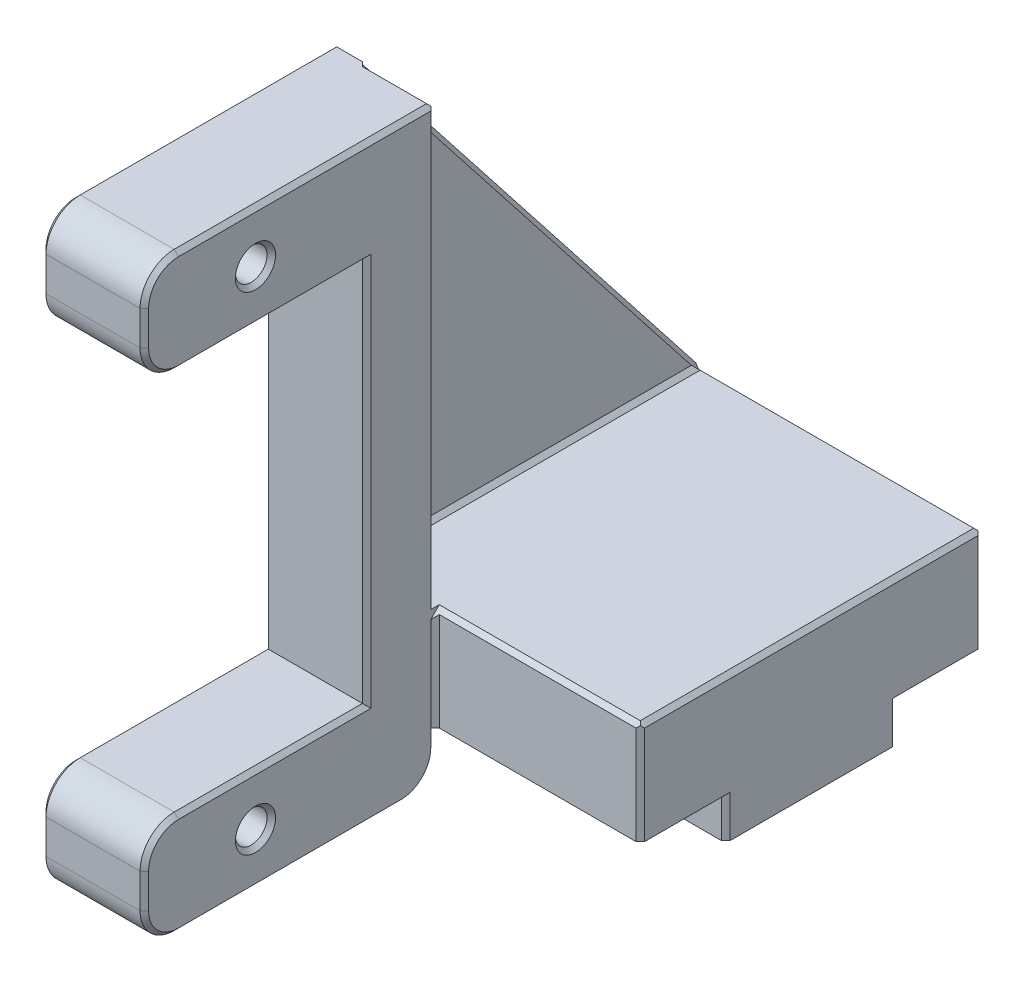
ISO-10303-21;
HEADER;
FILE_DESCRIPTION(('STEP AP214'),'2;1');
FILE_NAME('part.step','',(''),(''),'','','');
FILE_SCHEMA(('AUTOMOTIVE_DESIGN { 1 0 10303 214 1 1 1 1 }'));
ENDSEC;
DATA;
#1=APPLICATION_CONTEXT('core data for automotive mechanical design processes');
#2=APPLICATION_PROTOCOL_DEFINITION('international standard','automotive_design',2000,#1);
#3=PRODUCT_CONTEXT('',#1,'mechanical');
#4=PRODUCT('Part','Part','',(#3));
#5=PRODUCT_RELATED_PRODUCT_CATEGORY('part','',(#4));
#6=PRODUCT_DEFINITION_FORMATION('','',#4);
#7=PRODUCT_DEFINITION_CONTEXT('part definition',#1,'design');
#8=PRODUCT_DEFINITION('design','',#6,#7);
#9=PRODUCT_DEFINITION_SHAPE('','',#8);
#10=(LENGTH_UNIT() NAMED_UNIT(*) SI_UNIT(.MILLI.,.METRE.));
#11=(NAMED_UNIT(*) PLANE_ANGLE_UNIT() SI_UNIT($,.RADIAN.));
#12=(NAMED_UNIT(*) SI_UNIT($,.STERADIAN.) SOLID_ANGLE_UNIT());
#13=UNCERTAINTY_MEASURE_WITH_UNIT(LENGTH_MEASURE(1.E-05),#10,'distance_accuracy_value','');
#14=(GEOMETRIC_REPRESENTATION_CONTEXT(3) GLOBAL_UNCERTAINTY_ASSIGNED_CONTEXT((#13)) GLOBAL_UNIT_ASSIGNED_CONTEXT((#10,
#11,#12)) REPRESENTATION_CONTEXT('',''));
#15=CARTESIAN_POINT('',(0.,0.,0.));
#16=DIRECTION('',(0.,0.,1.));
#17=DIRECTION('',(1.,0.,0.));
#18=AXIS2_PLACEMENT_3D('',#15,#16,#17);
#19=CARTESIAN_POINT('',(0.,-14.25,-24.));
#20=DIRECTION('',(0.,1.,0.));
#21=DIRECTION('',(0.,0.,1.));
#22=AXIS2_PLACEMENT_3D('',#19,#20,#21);
#23=PLANE('',#22);
#24=DIRECTION('',(-1.,0.,0.));
#25=VECTOR('',#24,1.);
#26=CARTESIAN_POINT('',(0.,-14.25,-24.));
#27=LINE('',#26,#25);
#28=CARTESIAN_POINT('',(14.75,-14.25,-24.));
#29=VERTEX_POINT('',#28);
#30=CARTESIAN_POINT('',(-3.,-14.25,-24.));
#31=VERTEX_POINT('',#30);
#32=EDGE_CURVE('E389',#29,#31,#27,.T.);
#33=ORIENTED_EDGE('',*,*,#32,.F.);
#34=DIRECTION('',(0.707106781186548,0.,0.707106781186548));
#35=VECTOR('',#34,1.);
#36=CARTESIAN_POINT('',(15.,-14.25,-23.75));
#37=LINE('',#36,#35);
#38=CARTESIAN_POINT('',(15.,-14.25,-23.75));
#39=VERTEX_POINT('',#38);
#40=EDGE_CURVE('E853',#29,#39,#37,.T.);
#41=ORIENTED_EDGE('',*,*,#40,.T.);
#42=DIRECTION('',(0.,0.,-1.));
#43=VECTOR('',#42,1.);
#44=CARTESIAN_POINT('',(15.,-14.25,-24.));
#45=LINE('',#44,#43);
#46=CARTESIAN_POINT('',(15.,-14.25,-18.75));
#47=VERTEX_POINT('',#46);
#48=EDGE_CURVE('E1171',#47,#39,#45,.T.);
#49=ORIENTED_EDGE('',*,*,#48,.F.);
#50=DIRECTION('',(0.707106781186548,0.,0.707106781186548));
#51=VECTOR('',#50,1.);
#52=CARTESIAN_POINT('',(4.875,-14.25,-28.875));
#53=LINE('',#52,#51);
#54=CARTESIAN_POINT('',(14.75,-14.25,-19.));
#55=VERTEX_POINT('',#54);
#56=EDGE_CURVE('E517',#47,#55,#53,.F.);
#57=ORIENTED_EDGE('',*,*,#56,.T.);
#58=DIRECTION('',(1.,0.,0.));
#59=VECTOR('',#58,1.);
#60=CARTESIAN_POINT('',(-3.,-14.25,-19.));
#61=LINE('',#60,#59);
#62=CARTESIAN_POINT('',(-2.74999999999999,-14.25,-19.));
#63=VERTEX_POINT('',#62);
#64=EDGE_CURVE('E783',#63,#55,#61,.T.);
#65=ORIENTED_EDGE('',*,*,#64,.F.);
#66=DIRECTION('',(0.707106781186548,0.,-0.707106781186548));
#67=VECTOR('',#66,1.);
#68=CARTESIAN_POINT('',(1.125,-14.25,-22.875));
#69=LINE('',#68,#67);
#70=CARTESIAN_POINT('',(-3.,-14.25,-18.75));
#71=VERTEX_POINT('',#70);
#72=EDGE_CURVE('E407',#63,#71,#69,.F.);
#73=ORIENTED_EDGE('',*,*,#72,.T.);
#74=DIRECTION('',(0.,0.,1.));
#75=VECTOR('',#74,1.);
#76=CARTESIAN_POINT('',(-3.,-14.25,-24.));
#77=LINE('',#76,#75);
#78=EDGE_CURVE('E405',#31,#71,#77,.T.);
#79=ORIENTED_EDGE('',*,*,#78,.F.);
#80=EDGE_LOOP('',(#33,#41,#49,#57,#65,#73,#79));
#81=FACE_BOUND('',#80,.T.);
#82=ADVANCED_FACE('F41',(#81),#23,.F.);
#83=CARTESIAN_POINT('',(0.,0.,-4.));
#84=DIRECTION('',(0.,0.,1.));
#85=DIRECTION('',(1.,0.,0.));
#86=AXIS2_PLACEMENT_3D('',#83,#84,#85);
#87=PLANE('',#86);
#88=DIRECTION('',(0.,1.,0.));
#89=VECTOR('',#88,1.);
#90=CARTESIAN_POINT('',(-1.25,17.25,-4.));
#91=LINE('',#90,#89);
#92=CARTESIAN_POINT('',(-1.25,-8.,-4.));
#93=VERTEX_POINT('',#92);
#94=CARTESIAN_POINT('',(-1.25,17.,-4.));
#95=VERTEX_POINT('',#94);
#96=EDGE_CURVE('E888',#93,#95,#91,.T.);
#97=ORIENTED_EDGE('',*,*,#96,.T.);
#98=DIRECTION('',(1.,0.,0.));
#99=VECTOR('',#98,1.);
#100=CARTESIAN_POINT('',(2.74999999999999,17.,-4.));
#101=LINE('',#100,#99);
#102=CARTESIAN_POINT('',(2.74999999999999,17.,-4.));
#103=VERTEX_POINT('',#102);
#104=EDGE_CURVE('E983',#95,#103,#101,.T.);
#105=ORIENTED_EDGE('',*,*,#104,.T.);
#106=DIRECTION('',(0.,-1.,0.));
#107=VECTOR('',#106,1.);
#108=CARTESIAN_POINT('',(2.74999999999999,-8.25,-4.));
#109=LINE('',#108,#107);
#110=CARTESIAN_POINT('',(2.74999999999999,-8.,-4.));
#111=VERTEX_POINT('',#110);
#112=EDGE_CURVE('E885',#103,#111,#109,.T.);
#113=ORIENTED_EDGE('',*,*,#112,.T.);
#114=DIRECTION('',(-1.,0.,0.));
#115=VECTOR('',#114,1.);
#116=CARTESIAN_POINT('',(0.,-8.,-4.));
#117=LINE('',#116,#115);
#118=EDGE_CURVE('E913',#111,#93,#117,.T.);
#119=ORIENTED_EDGE('',*,*,#118,.T.);
#120=EDGE_LOOP('',(#97,#105,#113,#119));
#121=FACE_BOUND('',#120,.T.);
#122=ADVANCED_FACE('F1210',(#121),#87,.F.);
#123=CARTESIAN_POINT('',(0.,-8.25,-24.));
#124=DIRECTION('',(0.,1.,0.));
#125=DIRECTION('',(-1.,0.,0.));
#126=AXIS2_PLACEMENT_3D('',#123,#124,#125);
#127=PLANE('',#126);
#128=DIRECTION('',(0.,0.,1.));
#129=VECTOR('',#128,1.);
#130=CARTESIAN_POINT('',(3.,-8.25,-4.));
#131=LINE('',#130,#129);
#132=CARTESIAN_POINT('',(3.,-8.25,-4.25));
#133=VERTEX_POINT('',#132);
#134=CARTESIAN_POINT('',(3.,-8.25,-3.74999999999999));
#135=VERTEX_POINT('',#134);
#136=EDGE_CURVE('E892',#133,#135,#131,.T.);
#137=ORIENTED_EDGE('',*,*,#136,.F.);
#138=DIRECTION('',(1.,0.,0.));
#139=VECTOR('',#138,1.);
#140=CARTESIAN_POINT('',(14.75,-8.24999999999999,-4.25));
#141=LINE('',#140,#139);
#142=CARTESIAN_POINT('',(14.75,-8.24999999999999,-4.25));
#143=VERTEX_POINT('',#142);
#144=EDGE_CURVE('E944',#133,#143,#141,.T.);
#145=ORIENTED_EDGE('',*,*,#144,.T.);
#146=DIRECTION('',(0.,0.,-1.));
#147=VECTOR('',#146,1.);
#148=CARTESIAN_POINT('',(14.75,-8.24999999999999,-23.75));
#149=LINE('',#148,#147);
#150=CARTESIAN_POINT('',(14.75,-8.24999999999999,-23.75));
#151=VERTEX_POINT('',#150);
#152=EDGE_CURVE('E867',#143,#151,#149,.T.);
#153=ORIENTED_EDGE('',*,*,#152,.T.);
#154=DIRECTION('',(-1.,0.,0.));
#155=VECTOR('',#154,1.);
#156=CARTESIAN_POINT('',(0.,-8.25,-23.75));
#157=LINE('',#156,#155);
#158=CARTESIAN_POINT('',(-1.25,-8.25,-23.75));
#159=VERTEX_POINT('',#158);
#160=EDGE_CURVE('E528',#151,#159,#157,.T.);
#161=ORIENTED_EDGE('',*,*,#160,.T.);
#162=DIRECTION('',(0.,0.,1.));
#163=VECTOR('',#162,1.);
#164=CARTESIAN_POINT('',(-1.25,-8.25,-24.));
#165=LINE('',#164,#163);
#166=CARTESIAN_POINT('',(-1.25,-8.25,-4.24999999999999));
#167=VERTEX_POINT('',#166);
#168=EDGE_CURVE('E863',#159,#167,#165,.T.);
#169=ORIENTED_EDGE('',*,*,#168,.T.);
#170=DIRECTION('',(1.,0.,0.));
#171=VECTOR('',#170,1.);
#172=CARTESIAN_POINT('',(0.,-8.25,-4.24999999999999));
#173=LINE('',#172,#171);
#174=CARTESIAN_POINT('',(2.5,-8.25,-4.24999999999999));
#175=VERTEX_POINT('',#174);
#176=EDGE_CURVE('E932',#167,#175,#173,.T.);
#177=ORIENTED_EDGE('',*,*,#176,.T.);
#178=DIRECTION('',(0.707106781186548,0.,0.707106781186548));
#179=VECTOR('',#178,1.);
#180=CARTESIAN_POINT('',(3.,-8.25,-3.74999999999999));
#181=LINE('',#180,#179);
#182=EDGE_CURVE('E910',#175,#135,#181,.T.);
#183=ORIENTED_EDGE('',*,*,#182,.T.);
#184=EDGE_LOOP('',(#137,#145,#153,#161,#169,#177,#183));
#185=FACE_BOUND('',#184,.T.);
#186=ADVANCED_FACE('F1038',(#185),#127,.T.);
#187=DIRECTION('',(-1.,0.,0.));
#188=VECTOR('',#187,1.);
#189=CARTESIAN_POINT('',(0.,-14.25,-4.));
#190=LINE('',#189,#188);
#191=CARTESIAN_POINT('',(2.74999999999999,-14.25,-4.));
#192=VERTEX_POINT('',#191);
#193=CARTESIAN_POINT('',(-2.75,-14.25,-4.));
#194=VERTEX_POINT('',#193);
#195=EDGE_CURVE('E402',#192,#194,#190,.T.);
#196=ORIENTED_EDGE('',*,*,#195,.F.);
#197=DIRECTION('',(0.,-1.,0.));
#198=VECTOR('',#197,1.);
#199=CARTESIAN_POINT('',(2.74999999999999,-15.25,-4.));
#200=LINE('',#199,#198);
#201=CARTESIAN_POINT('',(2.74999999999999,-15.25,-4.));
#202=VERTEX_POINT('',#201);
#203=EDGE_CURVE('E611',#192,#202,#200,.T.);
#204=ORIENTED_EDGE('',*,*,#203,.T.);
#205=DIRECTION('',(-1.,0.,0.));
#206=VECTOR('',#205,1.);
#207=CARTESIAN_POINT('',(0.,-15.25,-4.));
#208=LINE('',#207,#206);
#209=CARTESIAN_POINT('',(-2.75,-15.25,-4.));
#210=VERTEX_POINT('',#209);
#211=EDGE_CURVE('E520',#202,#210,#208,.T.);
#212=ORIENTED_EDGE('',*,*,#211,.T.);
#213=DIRECTION('',(0.,1.,0.));
#214=VECTOR('',#213,1.);
#215=CARTESIAN_POINT('',(-2.75,0.,-4.));
#216=LINE('',#215,#214);
#217=EDGE_CURVE('E607',#210,#194,#216,.T.);
#218=ORIENTED_EDGE('',*,*,#217,.T.);
#219=EDGE_LOOP('',(#196,#204,#212,#218));
#220=FACE_BOUND('',#219,.T.);
#221=ADVANCED_FACE('F1137',(#220),#87,.F.);
#222=CARTESIAN_POINT('',(-3.,0.,-4.));
#223=DIRECTION('',(1.,0.,0.));
#224=DIRECTION('',(0.,0.,-1.));
#225=AXIS2_PLACEMENT_3D('',#222,#223,#224);
#226=PLANE('',#225);
#227=DIRECTION('',(0.,0.,-1.));
#228=VECTOR('',#227,1.);
#229=CARTESIAN_POINT('',(-3.,17.,-4.));
#230=LINE('',#229,#228);
#231=CARTESIAN_POINT('',(-3.,17.,11.));
#232=VERTEX_POINT('',#231);
#233=CARTESIAN_POINT('',(-3.,17.,-3.8783572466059));
#234=VERTEX_POINT('',#233);
#235=EDGE_CURVE('E714',#232,#234,#230,.T.);
#236=ORIENTED_EDGE('',*,*,#235,.T.);
#237=DIRECTION('',(0.,-0.786853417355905,-0.617139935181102));
#238=VECTOR('',#237,1.);
#239=CARTESIAN_POINT('',(-3.,-8.40428498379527,-23.803286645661));
#240=LINE('',#239,#238);
#241=CARTESIAN_POINT('',(-3.,-8.65509451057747,-24.));
#242=VERTEX_POINT('',#241);
#243=EDGE_CURVE('E419',#234,#242,#240,.T.);
#244=ORIENTED_EDGE('',*,*,#243,.T.);
#245=DIRECTION('',(0.,1.,0.));
#246=VECTOR('',#245,1.);
#247=CARTESIAN_POINT('',(-3.,0.,-24.));
#248=LINE('',#247,#246);
#249=EDGE_CURVE('E395',#31,#242,#248,.T.);
#250=ORIENTED_EDGE('',*,*,#249,.F.);
#251=ORIENTED_EDGE('',*,*,#78,.T.);
#252=DIRECTION('',(0.,-1.,0.));
#253=VECTOR('',#252,1.);
#254=CARTESIAN_POINT('',(-3.,0.,-18.75));
#255=LINE('',#254,#253);
#256=CARTESIAN_POINT('',(-3.,-16.7,-18.75));
#257=VERTEX_POINT('',#256);
#258=EDGE_CURVE('E468',#71,#257,#255,.T.);
#259=ORIENTED_EDGE('',*,*,#258,.T.);
#260=DIRECTION('',(0.,0.,-1.));
#261=VECTOR('',#260,1.);
#262=CARTESIAN_POINT('',(-3.,-16.7,-9.));
#263=LINE('',#262,#261);
#264=CARTESIAN_POINT('',(-3.,-16.7,-9.25));
#265=VERTEX_POINT('',#264);
#266=EDGE_CURVE('E1145',#265,#257,#263,.T.);
#267=ORIENTED_EDGE('',*,*,#266,.F.);
#268=DIRECTION('',(0.,1.,0.));
#269=VECTOR('',#268,1.);
#270=CARTESIAN_POINT('',(-3.,-14.25,-9.25));
#271=LINE('',#270,#269);
#272=CARTESIAN_POINT('',(-3.,-14.25,-9.25));
#273=VERTEX_POINT('',#272);
#274=EDGE_CURVE('E471',#265,#273,#271,.T.);
#275=ORIENTED_EDGE('',*,*,#274,.T.);
#276=CARTESIAN_POINT('',(-3.,-14.25,-3.75));
#277=VERTEX_POINT('',#276);
#278=EDGE_CURVE('E412',#273,#277,#77,.T.);
#279=ORIENTED_EDGE('',*,*,#278,.T.);
#280=DIRECTION('',(0.,-1.,0.));
#281=VECTOR('',#280,1.);
#282=CARTESIAN_POINT('',(-3.,0.,-3.75));
#283=LINE('',#282,#281);
#284=CARTESIAN_POINT('',(-3.,-15.25,-3.75));
#285=VERTEX_POINT('',#284);
#286=EDGE_CURVE('E723',#277,#285,#283,.T.);
#287=ORIENTED_EDGE('',*,*,#286,.T.);
#288=CARTESIAN_POINT('',(-3.,-15.25,-2.));
#289=DIRECTION('',(1.,0.,0.));
#290=DIRECTION('',(0.,0.,-1.));
#291=AXIS2_PLACEMENT_3D('',#288,#289,#290);
#292=CIRCLE('',#291,1.75);
#293=CARTESIAN_POINT('',(-3.,-17.,-2.));
#294=VERTEX_POINT('',#293);
#295=EDGE_CURVE('E720',#285,#294,#292,.F.);
#296=ORIENTED_EDGE('',*,*,#295,.T.);
#297=DIRECTION('',(0.,0.,1.));
#298=VECTOR('',#297,1.);
#299=CARTESIAN_POINT('',(-3.,-17.,-4.));
#300=LINE('',#299,#298);
#301=CARTESIAN_POINT('',(-3.,-17.,11.));
#302=VERTEX_POINT('',#301);
#303=EDGE_CURVE('E717',#294,#302,#300,.T.);
#304=ORIENTED_EDGE('',*,*,#303,.T.);
#305=CARTESIAN_POINT('',(-3.,-15.25,11.));
#306=DIRECTION('',(1.,0.,0.));
#307=DIRECTION('',(0.,0.,-1.));
#308=AXIS2_PLACEMENT_3D('',#305,#306,#307);
#309=CIRCLE('',#308,1.75);
#310=CARTESIAN_POINT('',(-3.,-15.25,12.75));
#311=VERTEX_POINT('',#310);
#312=EDGE_CURVE('E711',#302,#311,#309,.F.);
#313=ORIENTED_EDGE('',*,*,#312,.T.);
#314=DIRECTION('',(0.,1.,0.));
#315=VECTOR('',#314,1.);
#316=CARTESIAN_POINT('',(-3.,-13.25,12.75));
#317=LINE('',#316,#315);
#318=CARTESIAN_POINT('',(-3.,-13.25,12.75));
#319=VERTEX_POINT('',#318);
#320=EDGE_CURVE('E705',#311,#319,#317,.T.);
#321=ORIENTED_EDGE('',*,*,#320,.T.);
#322=CARTESIAN_POINT('',(-3.,-13.25,11.));
#323=DIRECTION('',(1.,0.,0.));
#324=DIRECTION('',(0.,0.,-1.));
#325=AXIS2_PLACEMENT_3D('',#322,#323,#324);
#326=CIRCLE('',#325,1.75);
#327=CARTESIAN_POINT('',(-3.,-11.5,11.));
#328=VERTEX_POINT('',#327);
#329=EDGE_CURVE('E699',#319,#328,#326,.F.);
#330=ORIENTED_EDGE('',*,*,#329,.T.);
#331=DIRECTION('',(0.,0.,-1.));
#332=VECTOR('',#331,1.);
#333=CARTESIAN_POINT('',(-3.,-11.5,0.));
#334=LINE('',#333,#332);
#335=CARTESIAN_POINT('',(-3.,-11.5,-0.25));
#336=VERTEX_POINT('',#335);
#337=EDGE_CURVE('E693',#328,#336,#334,.T.);
#338=ORIENTED_EDGE('',*,*,#337,.T.);
#339=DIRECTION('',(0.,1.,0.));
#340=VECTOR('',#339,1.);
#341=CARTESIAN_POINT('',(-3.,11.25,-0.25));
#342=LINE('',#341,#340);
#343=CARTESIAN_POINT('',(-3.,11.5,-0.25));
#344=VERTEX_POINT('',#343);
#345=EDGE_CURVE('E687',#336,#344,#342,.T.);
#346=ORIENTED_EDGE('',*,*,#345,.T.);
#347=DIRECTION('',(0.,0.,1.));
#348=VECTOR('',#347,1.);
#349=CARTESIAN_POINT('',(-3.,11.5,-4.));
#350=LINE('',#349,#348);
#351=CARTESIAN_POINT('',(-3.,11.5,11.));
#352=VERTEX_POINT('',#351);
#353=EDGE_CURVE('E690',#344,#352,#350,.T.);
#354=ORIENTED_EDGE('',*,*,#353,.T.);
#355=CARTESIAN_POINT('',(-3.,13.25,11.));
#356=DIRECTION('',(1.,0.,0.));
#357=DIRECTION('',(0.,0.,-1.));
#358=AXIS2_PLACEMENT_3D('',#355,#356,#357);
#359=CIRCLE('',#358,1.75);
#360=CARTESIAN_POINT('',(-3.,13.25,12.75));
#361=VERTEX_POINT('',#360);
#362=EDGE_CURVE('E696',#352,#361,#359,.F.);
#363=ORIENTED_EDGE('',*,*,#362,.T.);
#364=DIRECTION('',(0.,1.,0.));
#365=VECTOR('',#364,1.);
#366=CARTESIAN_POINT('',(-3.,15.25,12.75));
#367=LINE('',#366,#365);
#368=CARTESIAN_POINT('',(-3.,15.25,12.75));
#369=VERTEX_POINT('',#368);
#370=EDGE_CURVE('E702',#361,#369,#367,.T.);
#371=ORIENTED_EDGE('',*,*,#370,.T.);
#372=CARTESIAN_POINT('',(-3.,15.25,11.));
#373=DIRECTION('',(1.,0.,0.));
#374=DIRECTION('',(0.,0.,-1.));
#375=AXIS2_PLACEMENT_3D('',#372,#373,#374);
#376=CIRCLE('',#375,1.75);
#377=EDGE_CURVE('E708',#369,#232,#376,.F.);
#378=ORIENTED_EDGE('',*,*,#377,.T.);
#379=EDGE_LOOP('',(#236,#244,#250,#251,#259,#267,#275,#279,#287,#296,#304,#313,#321,#330,#338,
#346,#354,#363,#371,#378));
#380=FACE_BOUND('',#379,.T.);
#381=CARTESIAN_POINT('',(-3.,14.25,6.5));
#382=DIRECTION('',(1.,0.,0.));
#383=DIRECTION('',(0.,0.,-1.));
#384=AXIS2_PLACEMENT_3D('',#381,#382,#383);
#385=CIRCLE('',#384,1.17500000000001);
#386=CARTESIAN_POINT('',(-3.,14.25,5.32499999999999));
#387=VERTEX_POINT('',#386);
#388=EDGE_CURVE('E555',#387,#387,#385,.T.);
#389=ORIENTED_EDGE('',*,*,#388,.T.);
#390=EDGE_LOOP('',(#389));
#391=FACE_BOUND('',#390,.T.);
#392=CARTESIAN_POINT('',(-3.,-14.25,6.5));
#393=DIRECTION('',(1.,0.,0.));
#394=DIRECTION('',(0.,0.,-1.));
#395=AXIS2_PLACEMENT_3D('',#392,#393,#394);
#396=CIRCLE('',#395,1.17500000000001);
#397=CARTESIAN_POINT('',(-3.,-14.25,5.32499999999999));
#398=VERTEX_POINT('',#397);
#399=EDGE_CURVE('E551',#398,#398,#396,.T.);
#400=ORIENTED_EDGE('',*,*,#399,.T.);
#401=EDGE_LOOP('',(#400));
#402=FACE_BOUND('',#401,.T.);
#403=ADVANCED_FACE('F416',(#380,#391,#402),#226,.F.);
#404=CARTESIAN_POINT('',(0.,17.25,-4.));
#405=DIRECTION('',(0.,1.,0.));
#406=DIRECTION('',(0.,0.,1.));
#407=AXIS2_PLACEMENT_3D('',#404,#405,#406);
#408=PLANE('',#407);
#409=DIRECTION('',(0.,0.,-1.));
#410=VECTOR('',#409,1.);
#411=CARTESIAN_POINT('',(2.74999999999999,17.25,-4.));
#412=LINE('',#411,#410);
#413=CARTESIAN_POINT('',(2.74999999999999,17.25,11.));
#414=VERTEX_POINT('',#413);
#415=CARTESIAN_POINT('',(2.74999999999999,17.25,-3.74999999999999));
#416=VERTEX_POINT('',#415);
#417=EDGE_CURVE('E623',#414,#416,#412,.T.);
#418=ORIENTED_EDGE('',*,*,#417,.T.);
#419=DIRECTION('',(-1.,0.,0.));
#420=VECTOR('',#419,1.);
#421=CARTESIAN_POINT('',(-1.25,17.25,-3.74999999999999));
#422=LINE('',#421,#420);
#423=CARTESIAN_POINT('',(-0.999999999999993,17.25,-3.74999999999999));
#424=VERTEX_POINT('',#423);
#425=EDGE_CURVE('E979',#416,#424,#422,.T.);
#426=ORIENTED_EDGE('',*,*,#425,.T.);
#427=DIRECTION('',(0.707106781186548,0.,0.707106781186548));
#428=VECTOR('',#427,1.);
#429=CARTESIAN_POINT('',(-1.25,17.25,-4.));
#430=LINE('',#429,#428);
#431=CARTESIAN_POINT('',(-1.25,17.25,-4.));
#432=VERTEX_POINT('',#431);
#433=EDGE_CURVE('E976',#424,#432,#430,.F.);
#434=ORIENTED_EDGE('',*,*,#433,.T.);
#435=DIRECTION('',(-1.,0.,0.));
#436=VECTOR('',#435,1.);
#437=CARTESIAN_POINT('',(-1.5,17.25,-4.));
#438=LINE('',#437,#436);
#439=CARTESIAN_POINT('',(-2.75,17.25,-4.));
#440=VERTEX_POINT('',#439);
#441=EDGE_CURVE('E1174',#432,#440,#438,.T.);
#442=ORIENTED_EDGE('',*,*,#441,.T.);
#443=DIRECTION('',(0.,0.,1.));
#444=VECTOR('',#443,1.);
#445=CARTESIAN_POINT('',(-2.75,17.25,11.));
#446=LINE('',#445,#444);
#447=CARTESIAN_POINT('',(-2.75,17.25,11.));
#448=VERTEX_POINT('',#447);
#449=EDGE_CURVE('E620',#440,#448,#446,.T.);
#450=ORIENTED_EDGE('',*,*,#449,.T.);
#451=DIRECTION('',(-1.,0.,0.));
#452=VECTOR('',#451,1.);
#453=CARTESIAN_POINT('',(0.,17.25,11.));
#454=LINE('',#453,#452);
#455=EDGE_CURVE('E460',#448,#414,#454,.F.);
#456=ORIENTED_EDGE('',*,*,#455,.T.);
#457=EDGE_LOOP('',(#418,#426,#434,#442,#450,#456));
#458=FACE_BOUND('',#457,.T.);
#459=ADVANCED_FACE('F1181',(#458),#408,.T.);
#460=CARTESIAN_POINT('',(3.,0.,-4.));
#461=DIRECTION('',(1.,0.,0.));
#462=DIRECTION('',(0.,0.,-1.));
#463=AXIS2_PLACEMENT_3D('',#460,#461,#462);
#464=PLANE('',#463);
#465=CARTESIAN_POINT('',(3.,14.25,6.5));
#466=DIRECTION('',(1.,0.,0.));
#467=DIRECTION('',(0.,0.,-1.));
#468=AXIS2_PLACEMENT_3D('',#465,#466,#467);
#469=CIRCLE('',#468,1.175);
#470=CARTESIAN_POINT('',(3.,14.25,5.32499999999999));
#471=VERTEX_POINT('',#470);
#472=EDGE_CURVE('E547',#471,#471,#469,.F.);
#473=ORIENTED_EDGE('',*,*,#472,.T.);
#474=EDGE_LOOP('',(#473));
#475=FACE_BOUND('',#474,.T.);
#476=CARTESIAN_POINT('',(3.,-14.25,6.5));
#477=DIRECTION('',(1.,0.,0.));
#478=DIRECTION('',(0.,0.,-1.));
#479=AXIS2_PLACEMENT_3D('',#476,#477,#478);
#480=CIRCLE('',#479,1.175);
#481=CARTESIAN_POINT('',(3.,-14.25,5.32499999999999));
#482=VERTEX_POINT('',#481);
#483=EDGE_CURVE('E543',#482,#482,#480,.F.);
#484=ORIENTED_EDGE('',*,*,#483,.T.);
#485=EDGE_LOOP('',(#484));
#486=FACE_BOUND('',#485,.T.);
#487=DIRECTION('',(0.,1.,0.));
#488=VECTOR('',#487,1.);
#489=CARTESIAN_POINT('',(3.,-14.25,-3.74999999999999));
#490=LINE('',#489,#488);
#491=CARTESIAN_POINT('',(3.,-15.25,-3.74999999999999));
#492=VERTEX_POINT('',#491);
#493=CARTESIAN_POINT('',(3.,-14.25,-3.74999999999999));
#494=VERTEX_POINT('',#493);
#495=EDGE_CURVE('E603',#492,#494,#490,.T.);
#496=ORIENTED_EDGE('',*,*,#495,.T.);
#497=DIRECTION('',(0.,1.,0.));
#498=VECTOR('',#497,1.);
#499=CARTESIAN_POINT('',(3.,0.,-3.75000000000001));
#500=LINE('',#499,#498);
#501=CARTESIAN_POINT('',(3.,-8.74999999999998,-3.75000000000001));
#502=VERTEX_POINT('',#501);
#503=EDGE_CURVE('E998',#494,#502,#500,.T.);
#504=ORIENTED_EDGE('',*,*,#503,.T.);
#505=DIRECTION('',(0.,0.707106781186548,-0.707106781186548));
#506=VECTOR('',#505,1.);
#507=CARTESIAN_POINT('',(3.,-8.49999999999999,-4.));
#508=LINE('',#507,#506);
#509=EDGE_CURVE('E56',#502,#133,#508,.T.);
#510=ORIENTED_EDGE('',*,*,#509,.T.);
#511=ORIENTED_EDGE('',*,*,#136,.T.);
#512=DIRECTION('',(0.,1.,0.));
#513=VECTOR('',#512,1.);
#514=CARTESIAN_POINT('',(3.,17.,-3.74999999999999));
#515=LINE('',#514,#513);
#516=CARTESIAN_POINT('',(3.,17.,-3.74999999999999));
#517=VERTEX_POINT('',#516);
#518=EDGE_CURVE('E896',#135,#517,#515,.T.);
#519=ORIENTED_EDGE('',*,*,#518,.T.);
#520=DIRECTION('',(0.,0.,1.));
#521=VECTOR('',#520,1.);
#522=CARTESIAN_POINT('',(3.,17.,-4.));
#523=LINE('',#522,#521);
#524=CARTESIAN_POINT('',(3.,17.,11.));
#525=VERTEX_POINT('',#524);
#526=EDGE_CURVE('E597',#517,#525,#523,.T.);
#527=ORIENTED_EDGE('',*,*,#526,.T.);
#528=CARTESIAN_POINT('',(3.,15.25,11.));
#529=DIRECTION('',(1.,0.,0.));
#530=DIRECTION('',(0.,0.,-1.));
#531=AXIS2_PLACEMENT_3D('',#528,#529,#530);
#532=CIRCLE('',#531,1.74999999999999);
#533=CARTESIAN_POINT('',(3.,15.25,12.75));
#534=VERTEX_POINT('',#533);
#535=EDGE_CURVE('E591',#525,#534,#532,.T.);
#536=ORIENTED_EDGE('',*,*,#535,.T.);
#537=DIRECTION('',(0.,-1.,0.));
#538=VECTOR('',#537,1.);
#539=CARTESIAN_POINT('',(3.,0.,12.75));
#540=LINE('',#539,#538);
#541=CARTESIAN_POINT('',(3.,13.25,12.75));
#542=VERTEX_POINT('',#541);
#543=EDGE_CURVE('E585',#534,#542,#540,.T.);
#544=ORIENTED_EDGE('',*,*,#543,.T.);
#545=CARTESIAN_POINT('',(3.,13.25,11.));
#546=DIRECTION('',(1.,0.,0.));
#547=DIRECTION('',(0.,0.,-1.));
#548=AXIS2_PLACEMENT_3D('',#545,#546,#547);
#549=CIRCLE('',#548,1.74999999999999);
#550=CARTESIAN_POINT('',(3.,11.5,11.));
#551=VERTEX_POINT('',#550);
#552=EDGE_CURVE('E579',#542,#551,#549,.T.);
#553=ORIENTED_EDGE('',*,*,#552,.T.);
#554=DIRECTION('',(0.,0.,-1.));
#555=VECTOR('',#554,1.);
#556=CARTESIAN_POINT('',(3.,11.5,0.));
#557=LINE('',#556,#555);
#558=CARTESIAN_POINT('',(3.,11.5,-0.250000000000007));
#559=VERTEX_POINT('',#558);
#560=EDGE_CURVE('E573',#551,#559,#557,.T.);
#561=ORIENTED_EDGE('',*,*,#560,.T.);
#562=DIRECTION('',(0.,-1.,0.));
#563=VECTOR('',#562,1.);
#564=CARTESIAN_POINT('',(3.,0.,-0.250000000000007));
#565=LINE('',#564,#563);
#566=CARTESIAN_POINT('',(3.,-11.5,-0.250000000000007));
#567=VERTEX_POINT('',#566);
#568=EDGE_CURVE('E570',#559,#567,#565,.T.);
#569=ORIENTED_EDGE('',*,*,#568,.T.);
#570=DIRECTION('',(0.,0.,1.));
#571=VECTOR('',#570,1.);
#572=CARTESIAN_POINT('',(3.,-11.5,-4.));
#573=LINE('',#572,#571);
#574=CARTESIAN_POINT('',(3.,-11.5,11.));
#575=VERTEX_POINT('',#574);
#576=EDGE_CURVE('E567',#567,#575,#573,.T.);
#577=ORIENTED_EDGE('',*,*,#576,.T.);
#578=CARTESIAN_POINT('',(3.,-13.25,11.));
#579=DIRECTION('',(1.,0.,0.));
#580=DIRECTION('',(0.,0.,-1.));
#581=AXIS2_PLACEMENT_3D('',#578,#579,#580);
#582=CIRCLE('',#581,1.74999999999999);
#583=CARTESIAN_POINT('',(3.,-13.25,12.75));
#584=VERTEX_POINT('',#583);
#585=EDGE_CURVE('E576',#575,#584,#582,.T.);
#586=ORIENTED_EDGE('',*,*,#585,.T.);
#587=DIRECTION('',(0.,-1.,0.));
#588=VECTOR('',#587,1.);
#589=CARTESIAN_POINT('',(3.,0.,12.75));
#590=LINE('',#589,#588);
#591=CARTESIAN_POINT('',(3.,-15.25,12.75));
#592=VERTEX_POINT('',#591);
#593=EDGE_CURVE('E582',#584,#592,#590,.T.);
#594=ORIENTED_EDGE('',*,*,#593,.T.);
#595=CARTESIAN_POINT('',(3.,-15.25,11.));
#596=DIRECTION('',(1.,0.,0.));
#597=DIRECTION('',(0.,0.,-1.));
#598=AXIS2_PLACEMENT_3D('',#595,#596,#597);
#599=CIRCLE('',#598,1.74999999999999);
#600=CARTESIAN_POINT('',(3.,-17.,11.));
#601=VERTEX_POINT('',#600);
#602=EDGE_CURVE('E588',#592,#601,#599,.T.);
#603=ORIENTED_EDGE('',*,*,#602,.T.);
#604=DIRECTION('',(0.,0.,-1.));
#605=VECTOR('',#604,1.);
#606=CARTESIAN_POINT('',(3.,-17.,-2.));
#607=LINE('',#606,#605);
#608=CARTESIAN_POINT('',(3.,-17.,-2.));
#609=VERTEX_POINT('',#608);
#610=EDGE_CURVE('E594',#601,#609,#607,.T.);
#611=ORIENTED_EDGE('',*,*,#610,.T.);
#612=CARTESIAN_POINT('',(3.,-15.25,-2.));
#613=DIRECTION('',(1.,0.,0.));
#614=DIRECTION('',(0.,0.,-1.));
#615=AXIS2_PLACEMENT_3D('',#612,#613,#614);
#616=CIRCLE('',#615,1.74999999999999);
#617=EDGE_CURVE('E600',#609,#492,#616,.T.);
#618=ORIENTED_EDGE('',*,*,#617,.T.);
#619=EDGE_LOOP('',(#496,#504,#510,#511,#519,#527,#536,#544,#553,#561,#569,#577,#586,#594,#603,
#611,#618));
#620=FACE_BOUND('',#619,.T.);
#621=ADVANCED_FACE('F1014',(#475,#486,#620),#464,.T.);
#622=CARTESIAN_POINT('',(0.,-17.25,-4.));
#623=DIRECTION('',(0.,1.,0.));
#624=DIRECTION('',(0.,0.,1.));
#625=AXIS2_PLACEMENT_3D('',#622,#623,#624);
#626=PLANE('',#625);
#627=DIRECTION('',(-1.,0.,0.));
#628=VECTOR('',#627,1.);
#629=CARTESIAN_POINT('',(0.,-17.25,-2.));
#630=LINE('',#629,#628);
#631=CARTESIAN_POINT('',(-2.75,-17.25,-2.));
#632=VERTEX_POINT('',#631);
#633=CARTESIAN_POINT('',(2.74999999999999,-17.25,-2.));
#634=VERTEX_POINT('',#633);
#635=EDGE_CURVE('E524',#632,#634,#630,.F.);
#636=ORIENTED_EDGE('',*,*,#635,.T.);
#637=DIRECTION('',(0.,0.,1.));
#638=VECTOR('',#637,1.);
#639=CARTESIAN_POINT('',(2.74999999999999,-17.25,11.));
#640=LINE('',#639,#638);
#641=CARTESIAN_POINT('',(2.74999999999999,-17.25,11.));
#642=VERTEX_POINT('',#641);
#643=EDGE_CURVE('E630',#634,#642,#640,.T.);
#644=ORIENTED_EDGE('',*,*,#643,.T.);
#645=DIRECTION('',(-1.,0.,0.));
#646=VECTOR('',#645,1.);
#647=CARTESIAN_POINT('',(-3.,-17.25,11.));
#648=LINE('',#647,#646);
#649=CARTESIAN_POINT('',(-2.75,-17.25,11.));
#650=VERTEX_POINT('',#649);
#651=EDGE_CURVE('E436',#642,#650,#648,.T.);
#652=ORIENTED_EDGE('',*,*,#651,.T.);
#653=DIRECTION('',(0.,0.,-1.));
#654=VECTOR('',#653,1.);
#655=CARTESIAN_POINT('',(-2.75,-17.25,-4.));
#656=LINE('',#655,#654);
#657=EDGE_CURVE('E627',#650,#632,#656,.T.);
#658=ORIENTED_EDGE('',*,*,#657,.T.);
#659=EDGE_LOOP('',(#636,#644,#652,#658));
#660=FACE_BOUND('',#659,.T.);
#661=ADVANCED_FACE('F1123',(#660),#626,.F.);
#662=CARTESIAN_POINT('',(0.,0.,0.));
#663=DIRECTION('',(0.,0.,1.));
#664=DIRECTION('',(1.,0.,0.));
#665=AXIS2_PLACEMENT_3D('',#662,#663,#664);
#666=PLANE('',#665);
#667=DIRECTION('',(1.,0.,0.));
#668=VECTOR('',#667,1.);
#669=CARTESIAN_POINT('',(0.,-11.25,0.));
#670=LINE('',#669,#668);
#671=CARTESIAN_POINT('',(-2.75,-11.25,0.));
#672=VERTEX_POINT('',#671);
#673=CARTESIAN_POINT('',(2.74999999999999,-11.25,0.));
#674=VERTEX_POINT('',#673);
#675=EDGE_CURVE('E411',#672,#674,#670,.T.);
#676=ORIENTED_EDGE('',*,*,#675,.T.);
#677=DIRECTION('',(0.,1.,0.));
#678=VECTOR('',#677,1.);
#679=CARTESIAN_POINT('',(2.74999999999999,0.,0.));
#680=LINE('',#679,#678);
#681=CARTESIAN_POINT('',(2.74999999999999,11.25,0.));
#682=VERTEX_POINT('',#681);
#683=EDGE_CURVE('E678',#674,#682,#680,.T.);
#684=ORIENTED_EDGE('',*,*,#683,.T.);
#685=DIRECTION('',(1.,0.,0.));
#686=VECTOR('',#685,1.);
#687=CARTESIAN_POINT('',(0.,11.25,0.));
#688=LINE('',#687,#686);
#689=CARTESIAN_POINT('',(-2.75,11.25,0.));
#690=VERTEX_POINT('',#689);
#691=EDGE_CURVE('E432',#690,#682,#688,.T.);
#692=ORIENTED_EDGE('',*,*,#691,.F.);
#693=DIRECTION('',(0.,-1.,0.));
#694=VECTOR('',#693,1.);
#695=CARTESIAN_POINT('',(-2.75,-11.25,0.));
#696=LINE('',#695,#694);
#697=EDGE_CURVE('E675',#690,#672,#696,.T.);
#698=ORIENTED_EDGE('',*,*,#697,.T.);
#699=EDGE_LOOP('',(#676,#684,#692,#698));
#700=FACE_BOUND('',#699,.T.);
#701=ADVANCED_FACE('F1244',(#700),#666,.T.);
#702=CARTESIAN_POINT('',(0.,11.25,13.));
#703=DIRECTION('',(0.,1.,0.));
#704=DIRECTION('',(0.,0.,1.));
#705=AXIS2_PLACEMENT_3D('',#702,#703,#704);
#706=PLANE('',#705);
#707=ORIENTED_EDGE('',*,*,#691,.T.);
#708=DIRECTION('',(0.,0.,1.));
#709=VECTOR('',#708,1.);
#710=CARTESIAN_POINT('',(2.74999999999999,11.25,11.));
#711=LINE('',#710,#709);
#712=CARTESIAN_POINT('',(2.74999999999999,11.25,11.));
#713=VERTEX_POINT('',#712);
#714=EDGE_CURVE('E672',#682,#713,#711,.T.);
#715=ORIENTED_EDGE('',*,*,#714,.T.);
#716=DIRECTION('',(1.,0.,0.));
#717=VECTOR('',#716,1.);
#718=CARTESIAN_POINT('',(-3.,11.25,11.));
#719=LINE('',#718,#717);
#720=CARTESIAN_POINT('',(-2.75,11.25,11.));
#721=VERTEX_POINT('',#720);
#722=EDGE_CURVE('E464',#713,#721,#719,.F.);
#723=ORIENTED_EDGE('',*,*,#722,.T.);
#724=DIRECTION('',(0.,0.,-1.));
#725=VECTOR('',#724,1.);
#726=CARTESIAN_POINT('',(-2.75,11.25,13.));
#727=LINE('',#726,#725);
#728=EDGE_CURVE('E669',#721,#690,#727,.T.);
#729=ORIENTED_EDGE('',*,*,#728,.T.);
#730=EDGE_LOOP('',(#707,#715,#723,#729));
#731=FACE_BOUND('',#730,.T.);
#732=ADVANCED_FACE('F1240',(#731),#706,.F.);
#733=CARTESIAN_POINT('',(0.,0.,13.));
#734=DIRECTION('',(0.,0.,1.));
#735=DIRECTION('',(1.,0.,0.));
#736=AXIS2_PLACEMENT_3D('',#733,#734,#735);
#737=PLANE('',#736);
#738=DIRECTION('',(1.,0.,0.));
#739=VECTOR('',#738,1.);
#740=CARTESIAN_POINT('',(3.,13.25,13.));
#741=LINE('',#740,#739);
#742=CARTESIAN_POINT('',(-2.75,13.25,13.));
#743=VERTEX_POINT('',#742);
#744=CARTESIAN_POINT('',(2.74999999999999,13.25,13.));
#745=VERTEX_POINT('',#744);
#746=EDGE_CURVE('E452',#743,#745,#741,.T.);
#747=ORIENTED_EDGE('',*,*,#746,.T.);
#748=DIRECTION('',(0.,1.,0.));
#749=VECTOR('',#748,1.);
#750=CARTESIAN_POINT('',(2.74999999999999,0.,13.));
#751=LINE('',#750,#749);
#752=CARTESIAN_POINT('',(2.74999999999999,15.25,13.));
#753=VERTEX_POINT('',#752);
#754=EDGE_CURVE('E648',#745,#753,#751,.T.);
#755=ORIENTED_EDGE('',*,*,#754,.T.);
#756=DIRECTION('',(-1.,0.,0.));
#757=VECTOR('',#756,1.);
#758=CARTESIAN_POINT('',(0.,15.25,13.));
#759=LINE('',#758,#757);
#760=CARTESIAN_POINT('',(-2.75,15.25,13.));
#761=VERTEX_POINT('',#760);
#762=EDGE_CURVE('E456',#753,#761,#759,.T.);
#763=ORIENTED_EDGE('',*,*,#762,.T.);
#764=DIRECTION('',(0.,-1.,0.));
#765=VECTOR('',#764,1.);
#766=CARTESIAN_POINT('',(-2.75,13.25,13.));
#767=LINE('',#766,#765);
#768=EDGE_CURVE('E645',#761,#743,#767,.T.);
#769=ORIENTED_EDGE('',*,*,#768,.T.);
#770=EDGE_LOOP('',(#747,#755,#763,#769));
#771=FACE_BOUND('',#770,.T.);
#772=ADVANCED_FACE('F1220',(#771),#737,.T.);
#773=CARTESIAN_POINT('',(0.,-11.25,13.));
#774=DIRECTION('',(0.,1.,0.));
#775=DIRECTION('',(0.,0.,1.));
#776=AXIS2_PLACEMENT_3D('',#773,#774,#775);
#777=PLANE('',#776);
#778=DIRECTION('',(1.,0.,0.));
#779=VECTOR('',#778,1.);
#780=CARTESIAN_POINT('',(0.,-11.25,11.));
#781=LINE('',#780,#779);
#782=CARTESIAN_POINT('',(-2.75,-11.25,11.));
#783=VERTEX_POINT('',#782);
#784=CARTESIAN_POINT('',(2.74999999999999,-11.25,11.));
#785=VERTEX_POINT('',#784);
#786=EDGE_CURVE('E448',#783,#785,#781,.T.);
#787=ORIENTED_EDGE('',*,*,#786,.T.);
#788=DIRECTION('',(0.,0.,-1.));
#789=VECTOR('',#788,1.);
#790=CARTESIAN_POINT('',(2.74999999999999,-11.25,13.));
#791=LINE('',#790,#789);
#792=EDGE_CURVE('E684',#785,#674,#791,.T.);
#793=ORIENTED_EDGE('',*,*,#792,.T.);
#794=ORIENTED_EDGE('',*,*,#675,.F.);
#795=DIRECTION('',(0.,0.,1.));
#796=VECTOR('',#795,1.);
#797=CARTESIAN_POINT('',(-2.75,-11.25,11.));
#798=LINE('',#797,#796);
#799=EDGE_CURVE('E681',#672,#783,#798,.T.);
#800=ORIENTED_EDGE('',*,*,#799,.T.);
#801=EDGE_LOOP('',(#787,#793,#794,#800));
#802=FACE_BOUND('',#801,.T.);
#803=ADVANCED_FACE('F1262',(#802),#777,.T.);
#804=CARTESIAN_POINT('',(0.,0.,13.));
#805=DIRECTION('',(0.,0.,1.));
#806=DIRECTION('',(1.,0.,0.));
#807=AXIS2_PLACEMENT_3D('',#804,#805,#806);
#808=PLANE('',#807);
#809=DIRECTION('',(-1.,0.,0.));
#810=VECTOR('',#809,1.);
#811=CARTESIAN_POINT('',(3.,-15.25,13.));
#812=LINE('',#811,#810);
#813=CARTESIAN_POINT('',(-2.75,-15.25,13.));
#814=VERTEX_POINT('',#813);
#815=CARTESIAN_POINT('',(2.74999999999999,-15.25,13.));
#816=VERTEX_POINT('',#815);
#817=EDGE_CURVE('E444',#814,#816,#812,.F.);
#818=ORIENTED_EDGE('',*,*,#817,.T.);
#819=DIRECTION('',(0.,1.,0.));
#820=VECTOR('',#819,1.);
#821=CARTESIAN_POINT('',(2.74999999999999,0.,13.));
#822=LINE('',#821,#820);
#823=CARTESIAN_POINT('',(2.74999999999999,-13.25,13.));
#824=VERTEX_POINT('',#823);
#825=EDGE_CURVE('E654',#816,#824,#822,.T.);
#826=ORIENTED_EDGE('',*,*,#825,.T.);
#827=DIRECTION('',(1.,0.,0.));
#828=VECTOR('',#827,1.);
#829=CARTESIAN_POINT('',(0.,-13.25,13.));
#830=LINE('',#829,#828);
#831=CARTESIAN_POINT('',(-2.75,-13.25,13.));
#832=VERTEX_POINT('',#831);
#833=EDGE_CURVE('E440',#824,#832,#830,.F.);
#834=ORIENTED_EDGE('',*,*,#833,.T.);
#835=DIRECTION('',(0.,-1.,0.));
#836=VECTOR('',#835,1.);
#837=CARTESIAN_POINT('',(-2.75,-15.25,13.));
#838=LINE('',#837,#836);
#839=EDGE_CURVE('E651',#832,#814,#838,.T.);
#840=ORIENTED_EDGE('',*,*,#839,.T.);
#841=EDGE_LOOP('',(#818,#826,#834,#840));
#842=FACE_BOUND('',#841,.T.);
#843=ADVANCED_FACE('F1268',(#842),#808,.T.);
#844=CARTESIAN_POINT('',(-3.,14.25,6.5));
#845=DIRECTION('',(1.,0.,0.));
#846=DIRECTION('',(0.,0.,-1.));
#847=AXIS2_PLACEMENT_3D('',#844,#845,#846);
#848=CYLINDRICAL_SURFACE('',#847,0.925000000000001);
#849=CARTESIAN_POINT('',(2.74999999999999,14.25,6.5));
#850=DIRECTION('',(1.,0.,0.));
#851=DIRECTION('',(0.,0.,-1.));
#852=AXIS2_PLACEMENT_3D('',#849,#850,#851);
#853=CIRCLE('',#852,0.925000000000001);
#854=CARTESIAN_POINT('',(2.74999999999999,14.25,5.57499999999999));
#855=VERTEX_POINT('',#854);
#856=EDGE_CURVE('E539',#855,#855,#853,.T.);
#857=ORIENTED_EDGE('',*,*,#856,.T.);
#858=EDGE_LOOP('',(#857));
#859=FACE_BOUND('',#858,.T.);
#860=CARTESIAN_POINT('',(-2.74999999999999,14.25,6.5));
#861=DIRECTION('',(1.,0.,0.));
#862=DIRECTION('',(0.,0.,-1.));
#863=AXIS2_PLACEMENT_3D('',#860,#861,#862);
#864=CIRCLE('',#863,0.925000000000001);
#865=CARTESIAN_POINT('',(-2.74999999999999,14.25,5.57499999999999));
#866=VERTEX_POINT('',#865);
#867=EDGE_CURVE('E535',#866,#866,#864,.F.);
#868=ORIENTED_EDGE('',*,*,#867,.T.);
#869=EDGE_LOOP('',(#868));
#870=FACE_BOUND('',#869,.T.);
#871=ADVANCED_FACE('F1292',(#859,#870),#848,.F.);
#872=CARTESIAN_POINT('',(-3.,-14.25,6.5));
#873=DIRECTION('',(1.,0.,0.));
#874=DIRECTION('',(0.,0.,-1.));
#875=AXIS2_PLACEMENT_3D('',#872,#873,#874);
#876=CYLINDRICAL_SURFACE('',#875,0.925000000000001);
#877=CARTESIAN_POINT('',(2.74999999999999,-14.25,6.5));
#878=DIRECTION('',(1.,0.,0.));
#879=DIRECTION('',(0.,0.,-1.));
#880=AXIS2_PLACEMENT_3D('',#877,#878,#879);
#881=CIRCLE('',#880,0.925000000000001);
#882=CARTESIAN_POINT('',(2.74999999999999,-14.25,5.57499999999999));
#883=VERTEX_POINT('',#882);
#884=EDGE_CURVE('E563',#883,#883,#881,.T.);
#885=ORIENTED_EDGE('',*,*,#884,.T.);
#886=EDGE_LOOP('',(#885));
#887=FACE_BOUND('',#886,.T.);
#888=CARTESIAN_POINT('',(-2.74999999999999,-14.25,6.5));
#889=DIRECTION('',(1.,0.,0.));
#890=DIRECTION('',(0.,0.,-1.));
#891=AXIS2_PLACEMENT_3D('',#888,#889,#890);
#892=CIRCLE('',#891,0.925000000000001);
#893=CARTESIAN_POINT('',(-2.74999999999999,-14.25,5.57499999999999));
#894=VERTEX_POINT('',#893);
#895=EDGE_CURVE('E559',#894,#894,#892,.F.);
#896=ORIENTED_EDGE('',*,*,#895,.T.);
#897=EDGE_LOOP('',(#896));
#898=FACE_BOUND('',#897,.T.);
#899=ADVANCED_FACE('F1285',(#887,#898),#876,.F.);
#900=CARTESIAN_POINT('',(0.,-15.25,11.));
#901=DIRECTION('',(1.,0.,0.));
#902=DIRECTION('',(0.,0.,-1.));
#903=AXIS2_PLACEMENT_3D('',#900,#901,#902);
#904=CYLINDRICAL_SURFACE('',#903,2.);
#905=ORIENTED_EDGE('',*,*,#651,.F.);
#906=CARTESIAN_POINT('',(2.74999999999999,-15.25,11.));
#907=DIRECTION('',(1.,0.,0.));
#908=DIRECTION('',(0.,0.,-1.));
#909=AXIS2_PLACEMENT_3D('',#906,#907,#908);
#910=CIRCLE('',#909,2.);
#911=EDGE_CURVE('E642',#642,#816,#910,.F.);
#912=ORIENTED_EDGE('',*,*,#911,.T.);
#913=ORIENTED_EDGE('',*,*,#817,.F.);
#914=CARTESIAN_POINT('',(-2.75,-15.25,11.));
#915=DIRECTION('',(1.,0.,0.));
#916=DIRECTION('',(0.,0.,-1.));
#917=AXIS2_PLACEMENT_3D('',#914,#915,#916);
#918=CIRCLE('',#917,2.);
#919=EDGE_CURVE('E639',#814,#650,#918,.T.);
#920=ORIENTED_EDGE('',*,*,#919,.T.);
#921=EDGE_LOOP('',(#905,#912,#913,#920));
#922=FACE_BOUND('',#921,.T.);
#923=ADVANCED_FACE('F1283',(#922),#904,.T.);
#924=CARTESIAN_POINT('',(0.,-13.25,11.));
#925=DIRECTION('',(1.,0.,0.));
#926=DIRECTION('',(0.,0.,-1.));
#927=AXIS2_PLACEMENT_3D('',#924,#925,#926);
#928=CYLINDRICAL_SURFACE('',#927,2.);
#929=ORIENTED_EDGE('',*,*,#833,.F.);
#930=CARTESIAN_POINT('',(2.74999999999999,-13.25,11.));
#931=DIRECTION('',(1.,0.,0.));
#932=DIRECTION('',(0.,0.,-1.));
#933=AXIS2_PLACEMENT_3D('',#930,#931,#932);
#934=CIRCLE('',#933,2.);
#935=EDGE_CURVE('E666',#824,#785,#934,.F.);
#936=ORIENTED_EDGE('',*,*,#935,.T.);
#937=ORIENTED_EDGE('',*,*,#786,.F.);
#938=CARTESIAN_POINT('',(-2.75,-13.25,11.));
#939=DIRECTION('',(1.,0.,0.));
#940=DIRECTION('',(0.,0.,-1.));
#941=AXIS2_PLACEMENT_3D('',#938,#939,#940);
#942=CIRCLE('',#941,2.);
#943=EDGE_CURVE('E663',#783,#832,#942,.T.);
#944=ORIENTED_EDGE('',*,*,#943,.T.);
#945=EDGE_LOOP('',(#929,#936,#937,#944));
#946=FACE_BOUND('',#945,.T.);
#947=ADVANCED_FACE('F1265',(#946),#928,.T.);
#948=CARTESIAN_POINT('',(0.,15.25,11.));
#949=DIRECTION('',(-1.,0.,0.));
#950=DIRECTION('',(0.,0.,1.));
#951=AXIS2_PLACEMENT_3D('',#948,#949,#950);
#952=CYLINDRICAL_SURFACE('',#951,2.);
#953=ORIENTED_EDGE('',*,*,#762,.F.);
#954=CARTESIAN_POINT('',(2.74999999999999,15.25,11.));
#955=DIRECTION('',(1.,0.,0.));
#956=DIRECTION('',(0.,0.,-1.));
#957=AXIS2_PLACEMENT_3D('',#954,#955,#956);
#958=CIRCLE('',#957,2.);
#959=EDGE_CURVE('E636',#753,#414,#958,.F.);
#960=ORIENTED_EDGE('',*,*,#959,.T.);
#961=ORIENTED_EDGE('',*,*,#455,.F.);
#962=CARTESIAN_POINT('',(-2.75,15.25,11.));
#963=DIRECTION('',(1.,0.,0.));
#964=DIRECTION('',(0.,0.,-1.));
#965=AXIS2_PLACEMENT_3D('',#962,#963,#964);
#966=CIRCLE('',#965,2.);
#967=EDGE_CURVE('E633',#448,#761,#966,.T.);
#968=ORIENTED_EDGE('',*,*,#967,.T.);
#969=EDGE_LOOP('',(#953,#960,#961,#968));
#970=FACE_BOUND('',#969,.T.);
#971=ADVANCED_FACE('F1217',(#970),#952,.T.);
#972=CARTESIAN_POINT('',(0.,13.25,11.));
#973=DIRECTION('',(-1.,0.,0.));
#974=DIRECTION('',(0.,0.,1.));
#975=AXIS2_PLACEMENT_3D('',#972,#973,#974);
#976=CYLINDRICAL_SURFACE('',#975,2.);
#977=ORIENTED_EDGE('',*,*,#722,.F.);
#978=CARTESIAN_POINT('',(2.74999999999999,13.25,11.));
#979=DIRECTION('',(1.,0.,0.));
#980=DIRECTION('',(0.,0.,-1.));
#981=AXIS2_PLACEMENT_3D('',#978,#979,#980);
#982=CIRCLE('',#981,2.);
#983=EDGE_CURVE('E660',#713,#745,#982,.F.);
#984=ORIENTED_EDGE('',*,*,#983,.T.);
#985=ORIENTED_EDGE('',*,*,#746,.F.);
#986=CARTESIAN_POINT('',(-2.75,13.25,11.));
#987=DIRECTION('',(1.,0.,0.));
#988=DIRECTION('',(0.,0.,-1.));
#989=AXIS2_PLACEMENT_3D('',#986,#987,#988);
#990=CIRCLE('',#989,2.);
#991=EDGE_CURVE('E657',#743,#721,#990,.T.);
#992=ORIENTED_EDGE('',*,*,#991,.T.);
#993=EDGE_LOOP('',(#977,#984,#985,#992));
#994=FACE_BOUND('',#993,.T.);
#995=ADVANCED_FACE('F1238',(#994),#976,.T.);
#996=CARTESIAN_POINT('',(15.,-14.25,-4.25000000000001));
#997=VERTEX_POINT('',#996);
#998=CARTESIAN_POINT('',(15.,-14.25,-9.25));
#999=VERTEX_POINT('',#998);
#1000=EDGE_CURVE('E1168',#997,#999,#45,.T.);
#1001=ORIENTED_EDGE('',*,*,#1000,.F.);
#1002=DIRECTION('',(0.707106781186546,0.,-0.707106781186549));
#1003=VECTOR('',#1002,1.);
#1004=CARTESIAN_POINT('',(15.,-14.25,-4.25000000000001));
#1005=LINE('',#1004,#1003);
#1006=CARTESIAN_POINT('',(14.75,-14.25,-4.));
#1007=VERTEX_POINT('',#1006);
#1008=EDGE_CURVE('E856',#997,#1007,#1005,.F.);
#1009=ORIENTED_EDGE('',*,*,#1008,.T.);
#1010=DIRECTION('',(-1.,0.,0.));
#1011=VECTOR('',#1010,1.);
#1012=CARTESIAN_POINT('',(15.,-14.25,-4.));
#1013=LINE('',#1012,#1011);
#1014=CARTESIAN_POINT('',(3.24999999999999,-14.25,-4.));
#1015=VERTEX_POINT('',#1014);
#1016=EDGE_CURVE('E1008',#1007,#1015,#1013,.T.);
#1017=ORIENTED_EDGE('',*,*,#1016,.T.);
#1018=DIRECTION('',(-0.707106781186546,0.,0.707106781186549));
#1019=VECTOR('',#1018,1.);
#1020=CARTESIAN_POINT('',(11.625,-14.25,-12.375));
#1021=LINE('',#1020,#1019);
#1022=EDGE_CURVE('E50',#1015,#494,#1021,.T.);
#1023=ORIENTED_EDGE('',*,*,#1022,.T.);
#1024=DIRECTION('',(-0.707106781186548,0.,-0.707106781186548));
#1025=VECTOR('',#1024,1.);
#1026=CARTESIAN_POINT('',(-8.625,-14.25,-15.375));
#1027=LINE('',#1026,#1025);
#1028=EDGE_CURVE('E726',#494,#192,#1027,.T.);
#1029=ORIENTED_EDGE('',*,*,#1028,.T.);
#1030=ORIENTED_EDGE('',*,*,#195,.T.);
#1031=DIRECTION('',(0.707106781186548,0.,-0.707106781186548));
#1032=VECTOR('',#1031,1.);
#1033=CARTESIAN_POINT('',(8.625,-14.25,-15.375));
#1034=LINE('',#1033,#1032);
#1035=EDGE_CURVE('E729',#194,#277,#1034,.F.);
#1036=ORIENTED_EDGE('',*,*,#1035,.T.);
#1037=ORIENTED_EDGE('',*,*,#278,.F.);
#1038=DIRECTION('',(0.707106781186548,0.,0.707106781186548));
#1039=VECTOR('',#1038,1.);
#1040=CARTESIAN_POINT('',(-8.875,-14.25,-15.125));
#1041=LINE('',#1040,#1039);
#1042=CARTESIAN_POINT('',(-2.75,-14.25,-9.));
#1043=VERTEX_POINT('',#1042);
#1044=EDGE_CURVE('E508',#273,#1043,#1041,.T.);
#1045=ORIENTED_EDGE('',*,*,#1044,.T.);
#1046=DIRECTION('',(1.,0.,0.));
#1047=VECTOR('',#1046,1.);
#1048=CARTESIAN_POINT('',(-3.,-14.25,-9.));
#1049=LINE('',#1048,#1047);
#1050=CARTESIAN_POINT('',(14.75,-14.25,-9.));
#1051=VERTEX_POINT('',#1050);
#1052=EDGE_CURVE('E1152',#1043,#1051,#1049,.T.);
#1053=ORIENTED_EDGE('',*,*,#1052,.T.);
#1054=DIRECTION('',(0.707106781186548,0.,-0.707106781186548));
#1055=VECTOR('',#1054,1.);
#1056=CARTESIAN_POINT('',(14.875,-14.25,-9.125));
#1057=LINE('',#1056,#1055);
#1058=EDGE_CURVE('E513',#1051,#999,#1057,.T.);
#1059=ORIENTED_EDGE('',*,*,#1058,.T.);
#1060=EDGE_LOOP('',(#1001,#1009,#1017,#1023,#1029,#1030,#1036,#1037,#1045,#1053,#1059));
#1061=FACE_BOUND('',#1060,.T.);
#1062=ADVANCED_FACE('F1005',(#1061),#23,.F.);
#1063=CARTESIAN_POINT('',(0.,0.,-24.));
#1064=DIRECTION('',(0.,0.,-1.));
#1065=DIRECTION('',(-1.,0.,0.));
#1066=AXIS2_PLACEMENT_3D('',#1063,#1064,#1065);
#1067=PLANE('',#1066);
#1068=DIRECTION('',(0.525180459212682,-0.850990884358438,0.));
#1069=VECTOR('',#1068,1.);
#1070=CARTESIAN_POINT('',(-4.95444581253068,-3.05758636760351,-24.));
#1071=LINE('',#1070,#1069);
#1072=CARTESIAN_POINT('',(-1.75,-8.25,-24.));
#1073=VERTEX_POINT('',#1072);
#1074=CARTESIAN_POINT('',(-1.59571501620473,-8.49999999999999,-24.));
#1075=VERTEX_POINT('',#1074);
#1076=EDGE_CURVE('E959',#1073,#1075,#1071,.T.);
#1077=ORIENTED_EDGE('',*,*,#1076,.T.);
#1078=DIRECTION('',(1.,0.,0.));
#1079=VECTOR('',#1078,1.);
#1080=CARTESIAN_POINT('',(0.,-8.49999999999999,-24.));
#1081=LINE('',#1080,#1079);
#1082=CARTESIAN_POINT('',(14.75,-8.49999999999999,-24.));
#1083=VERTEX_POINT('',#1082);
#1084=EDGE_CURVE('E532',#1075,#1083,#1081,.T.);
#1085=ORIENTED_EDGE('',*,*,#1084,.T.);
#1086=DIRECTION('',(0.,-1.,0.));
#1087=VECTOR('',#1086,1.);
#1088=CARTESIAN_POINT('',(14.75,-14.25,-24.));
#1089=LINE('',#1088,#1087);
#1090=EDGE_CURVE('E398',#1083,#29,#1089,.T.);
#1091=ORIENTED_EDGE('',*,*,#1090,.T.);
#1092=ORIENTED_EDGE('',*,*,#32,.T.);
#1093=ORIENTED_EDGE('',*,*,#249,.T.);
#1094=DIRECTION('',(0.52518045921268,0.85099088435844,0.));
#1095=VECTOR('',#1094,1.);
#1096=CARTESIAN_POINT('',(1.69561112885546,-1.04642934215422,-24.));
#1097=LINE('',#1096,#1095);
#1098=CARTESIAN_POINT('',(-2.75,-8.25,-24.));
#1099=VERTEX_POINT('',#1098);
#1100=EDGE_CURVE('E848',#242,#1099,#1097,.T.);
#1101=ORIENTED_EDGE('',*,*,#1100,.T.);
#1102=DIRECTION('',(-1.,0.,0.));
#1103=VECTOR('',#1102,1.);
#1104=CARTESIAN_POINT('',(-1.5,-8.25,-24.));
#1105=LINE('',#1104,#1103);
#1106=EDGE_CURVE('E427',#1073,#1099,#1105,.T.);
#1107=ORIENTED_EDGE('',*,*,#1106,.F.);
#1108=EDGE_LOOP('',(#1077,#1085,#1091,#1092,#1093,#1101,#1107));
#1109=FACE_BOUND('',#1108,.T.);
#1110=ADVANCED_FACE('F392',(#1109),#1067,.T.);
#1111=CARTESIAN_POINT('',(-1.5,-8.25,-24.));
#1112=DIRECTION('',(0.,0.617139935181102,-0.786853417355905));
#1113=DIRECTION('',(0.,0.786853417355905,0.617139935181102));
#1114=AXIS2_PLACEMENT_3D('',#1111,#1112,#1113);
#1115=PLANE('',#1114);
#1116=DIRECTION('',(0.525180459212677,0.669605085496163,0.525180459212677));
#1117=VECTOR('',#1116,1.);
#1118=CARTESIAN_POINT('',(-7.31619548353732,9.51560075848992,-10.0661954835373));
#1119=LINE('',#1118,#1117);
#1120=CARTESIAN_POINT('',(-1.75,16.6125,-4.5));
#1121=VERTEX_POINT('',#1120);
#1122=EDGE_CURVE('E907',#432,#1121,#1119,.F.);
#1123=ORIENTED_EDGE('',*,*,#1122,.T.);
#1124=DIRECTION('',(0.,-0.786853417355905,-0.617139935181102));
#1125=VECTOR('',#1124,1.);
#1126=CARTESIAN_POINT('',(-1.75,-8.25,-24.));
#1127=LINE('',#1126,#1125);
#1128=EDGE_CURVE('E955',#1121,#1073,#1127,.T.);
#1129=ORIENTED_EDGE('',*,*,#1128,.T.);
#1130=ORIENTED_EDGE('',*,*,#1106,.T.);
#1131=DIRECTION('',(0.,0.786853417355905,0.617139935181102));
#1132=VECTOR('',#1131,1.);
#1133=CARTESIAN_POINT('',(-2.75,17.,-4.19607843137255));
#1134=LINE('',#1133,#1132);
#1135=EDGE_CURVE('E872',#1099,#440,#1134,.T.);
#1136=ORIENTED_EDGE('',*,*,#1135,.T.);
#1137=ORIENTED_EDGE('',*,*,#441,.F.);
#1138=EDGE_LOOP('',(#1123,#1129,#1130,#1136,#1137));
#1139=FACE_BOUND('',#1138,.T.);
#1140=ADVANCED_FACE('F1196',(#1139),#1115,.T.);
#1141=CARTESIAN_POINT('',(-1.5,0.,0.));
#1142=DIRECTION('',(-1.,0.,0.));
#1143=DIRECTION('',(0.,0.,1.));
#1144=AXIS2_PLACEMENT_3D('',#1141,#1142,#1143);
#1145=PLANE('',#1144);
#1146=DIRECTION('',(0.,0.,-1.));
#1147=VECTOR('',#1146,1.);
#1148=CARTESIAN_POINT('',(-1.5,-8.,0.));
#1149=LINE('',#1148,#1147);
#1150=CARTESIAN_POINT('',(-1.5,-8.,-4.25));
#1151=VERTEX_POINT('',#1150);
#1152=CARTESIAN_POINT('',(-1.5,-8.,-23.4862003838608));
#1153=VERTEX_POINT('',#1152);
#1154=EDGE_CURVE('E881',#1151,#1153,#1149,.T.);
#1155=ORIENTED_EDGE('',*,*,#1154,.T.);
#1156=DIRECTION('',(0.,0.786853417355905,0.617139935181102));
#1157=VECTOR('',#1156,1.);
#1158=CARTESIAN_POINT('',(-1.5,16.7769650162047,-4.05328664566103));
#1159=LINE('',#1158,#1157);
#1160=CARTESIAN_POINT('',(-1.5,16.5261554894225,-4.25));
#1161=VERTEX_POINT('',#1160);
#1162=EDGE_CURVE('E962',#1153,#1161,#1159,.T.);
#1163=ORIENTED_EDGE('',*,*,#1162,.T.);
#1164=DIRECTION('',(0.,-1.,0.));
#1165=VECTOR('',#1164,1.);
#1166=CARTESIAN_POINT('',(-1.5,-8.25,-4.25));
#1167=LINE('',#1166,#1165);
#1168=EDGE_CURVE('E878',#1161,#1151,#1167,.T.);
#1169=ORIENTED_EDGE('',*,*,#1168,.T.);
#1170=EDGE_LOOP('',(#1155,#1163,#1169));
#1171=FACE_BOUND('',#1170,.T.);
#1172=ADVANCED_FACE('F1204',(#1171),#1145,.F.);
#1173=CARTESIAN_POINT('',(15.,-8.25,-4.));
#1174=DIRECTION('',(0.,0.,-1.));
#1175=DIRECTION('',(0.,1.,0.));
#1176=AXIS2_PLACEMENT_3D('',#1173,#1174,#1175);
#1177=PLANE('',#1176);
#1178=DIRECTION('',(-1.,0.,0.));
#1179=VECTOR('',#1178,1.);
#1180=CARTESIAN_POINT('',(3.,-8.5,-4.));
#1181=LINE('',#1180,#1179);
#1182=CARTESIAN_POINT('',(14.75,-8.49999999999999,-4.));
#1183=VERTEX_POINT('',#1182);
#1184=CARTESIAN_POINT('',(3.24999999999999,-8.5,-4.));
#1185=VERTEX_POINT('',#1184);
#1186=EDGE_CURVE('E940',#1183,#1185,#1181,.T.);
#1187=ORIENTED_EDGE('',*,*,#1186,.T.);
#1188=DIRECTION('',(0.,-1.,0.));
#1189=VECTOR('',#1188,1.);
#1190=CARTESIAN_POINT('',(3.24999999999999,-8.25,-4.));
#1191=LINE('',#1190,#1189);
#1192=EDGE_CURVE('E995',#1185,#1015,#1191,.T.);
#1193=ORIENTED_EDGE('',*,*,#1192,.T.);
#1194=ORIENTED_EDGE('',*,*,#1016,.F.);
#1195=DIRECTION('',(0.,1.,0.));
#1196=VECTOR('',#1195,1.);
#1197=CARTESIAN_POINT('',(14.75,-8.25,-4.));
#1198=LINE('',#1197,#1196);
#1199=EDGE_CURVE('E859',#1007,#1183,#1198,.T.);
#1200=ORIENTED_EDGE('',*,*,#1199,.T.);
#1201=EDGE_LOOP('',(#1187,#1193,#1194,#1200));
#1202=FACE_BOUND('',#1201,.T.);
#1203=ADVANCED_FACE('F1023',(#1202),#1177,.F.);
#1204=CARTESIAN_POINT('',(15.,0.,0.));
#1205=DIRECTION('',(-1.,0.,0.));
#1206=DIRECTION('',(0.,0.,1.));
#1207=AXIS2_PLACEMENT_3D('',#1204,#1205,#1206);
#1208=PLANE('',#1207);
#1209=ORIENTED_EDGE('',*,*,#48,.T.);
#1210=DIRECTION('',(0.,1.,0.));
#1211=VECTOR('',#1210,1.);
#1212=CARTESIAN_POINT('',(15.,-8.49999999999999,-23.75));
#1213=LINE('',#1212,#1211);
#1214=CARTESIAN_POINT('',(15.,-8.5,-23.75));
#1215=VERTEX_POINT('',#1214);
#1216=EDGE_CURVE('E838',#39,#1215,#1213,.T.);
#1217=ORIENTED_EDGE('',*,*,#1216,.T.);
#1218=DIRECTION('',(0.,0.,1.));
#1219=VECTOR('',#1218,1.);
#1220=CARTESIAN_POINT('',(15.,-8.5,-4.));
#1221=LINE('',#1220,#1219);
#1222=CARTESIAN_POINT('',(15.,-8.5,-4.25000000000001));
#1223=VERTEX_POINT('',#1222);
#1224=EDGE_CURVE('E733',#1215,#1223,#1221,.T.);
#1225=ORIENTED_EDGE('',*,*,#1224,.T.);
#1226=DIRECTION('',(0.,-1.,0.));
#1227=VECTOR('',#1226,1.);
#1228=CARTESIAN_POINT('',(15.,0.,-4.25000000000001));
#1229=LINE('',#1228,#1227);
#1230=EDGE_CURVE('E835',#1223,#997,#1229,.T.);
#1231=ORIENTED_EDGE('',*,*,#1230,.T.);
#1232=ORIENTED_EDGE('',*,*,#1000,.T.);
#1233=DIRECTION('',(0.,-1.,0.));
#1234=VECTOR('',#1233,1.);
#1235=CARTESIAN_POINT('',(15.,-16.7,-9.25));
#1236=LINE('',#1235,#1234);
#1237=CARTESIAN_POINT('',(15.,-16.7,-9.25));
#1238=VERTEX_POINT('',#1237);
#1239=EDGE_CURVE('E505',#999,#1238,#1236,.T.);
#1240=ORIENTED_EDGE('',*,*,#1239,.T.);
#1241=DIRECTION('',(0.,0.,-1.));
#1242=VECTOR('',#1241,1.);
#1243=CARTESIAN_POINT('',(15.,-16.7,-9.));
#1244=LINE('',#1243,#1242);
#1245=CARTESIAN_POINT('',(15.,-16.7,-18.75));
#1246=VERTEX_POINT('',#1245);
#1247=EDGE_CURVE('E1939',#1238,#1246,#1244,.T.);
#1248=ORIENTED_EDGE('',*,*,#1247,.T.);
#1249=DIRECTION('',(0.,1.,0.));
#1250=VECTOR('',#1249,1.);
#1251=CARTESIAN_POINT('',(15.,0.,-18.75));
#1252=LINE('',#1251,#1250);
#1253=EDGE_CURVE('E501',#1246,#47,#1252,.T.);
#1254=ORIENTED_EDGE('',*,*,#1253,.T.);
#1255=EDGE_LOOP('',(#1209,#1217,#1225,#1231,#1232,#1240,#1248,#1254));
#1256=FACE_BOUND('',#1255,.T.);
#1257=ADVANCED_FACE('F1454',(#1256),#1208,.F.);
#1258=CARTESIAN_POINT('',(-3.,-16.7,-19.));
#1259=DIRECTION('',(0.,0.,1.));
#1260=DIRECTION('',(1.,0.,0.));
#1261=AXIS2_PLACEMENT_3D('',#1258,#1259,#1260);
#1262=PLANE('',#1261);
#1263=DIRECTION('',(1.,0.,0.));
#1264=VECTOR('',#1263,1.);
#1265=CARTESIAN_POINT('',(-3.,-16.7,-19.));
#1266=LINE('',#1265,#1264);
#1267=CARTESIAN_POINT('',(-2.74999999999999,-16.7,-19.));
#1268=VERTEX_POINT('',#1267);
#1269=CARTESIAN_POINT('',(14.75,-16.7,-19.));
#1270=VERTEX_POINT('',#1269);
#1271=EDGE_CURVE('E1162',#1268,#1270,#1266,.T.);
#1272=ORIENTED_EDGE('',*,*,#1271,.F.);
#1273=DIRECTION('',(0.,1.,0.));
#1274=VECTOR('',#1273,1.);
#1275=CARTESIAN_POINT('',(-2.74999999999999,-16.7,-19.));
#1276=LINE('',#1275,#1274);
#1277=EDGE_CURVE('E497',#1268,#63,#1276,.T.);
#1278=ORIENTED_EDGE('',*,*,#1277,.T.);
#1279=ORIENTED_EDGE('',*,*,#64,.T.);
#1280=DIRECTION('',(0.,-1.,0.));
#1281=VECTOR('',#1280,1.);
#1282=CARTESIAN_POINT('',(14.75,-16.7,-19.));
#1283=LINE('',#1282,#1281);
#1284=EDGE_CURVE('E494',#55,#1270,#1283,.T.);
#1285=ORIENTED_EDGE('',*,*,#1284,.T.);
#1286=EDGE_LOOP('',(#1272,#1278,#1279,#1285));
#1287=FACE_BOUND('',#1286,.T.);
#1288=ADVANCED_FACE('F1611',(#1287),#1262,.F.);
#1289=CARTESIAN_POINT('',(-3.,-16.7,-9.));
#1290=DIRECTION('',(0.,0.,1.));
#1291=DIRECTION('',(1.,0.,0.));
#1292=AXIS2_PLACEMENT_3D('',#1289,#1290,#1291);
#1293=PLANE('',#1292);
#1294=ORIENTED_EDGE('',*,*,#1052,.F.);
#1295=DIRECTION('',(0.,-1.,0.));
#1296=VECTOR('',#1295,1.);
#1297=CARTESIAN_POINT('',(-2.75,-16.7,-9.));
#1298=LINE('',#1297,#1296);
#1299=CARTESIAN_POINT('',(-2.75,-16.7,-9.));
#1300=VERTEX_POINT('',#1299);
#1301=EDGE_CURVE('E479',#1043,#1300,#1298,.T.);
#1302=ORIENTED_EDGE('',*,*,#1301,.T.);
#1303=DIRECTION('',(1.,0.,0.));
#1304=VECTOR('',#1303,1.);
#1305=CARTESIAN_POINT('',(-3.,-16.7,-9.));
#1306=LINE('',#1305,#1304);
#1307=CARTESIAN_POINT('',(14.75,-16.7,-9.));
#1308=VERTEX_POINT('',#1307);
#1309=EDGE_CURVE('E1942',#1300,#1308,#1306,.T.);
#1310=ORIENTED_EDGE('',*,*,#1309,.T.);
#1311=DIRECTION('',(0.,1.,0.));
#1312=VECTOR('',#1311,1.);
#1313=CARTESIAN_POINT('',(14.75,-14.25,-9.));
#1314=LINE('',#1313,#1312);
#1315=EDGE_CURVE('E475',#1308,#1051,#1314,.T.);
#1316=ORIENTED_EDGE('',*,*,#1315,.T.);
#1317=EDGE_LOOP('',(#1294,#1302,#1310,#1316));
#1318=FACE_BOUND('',#1317,.T.);
#1319=ADVANCED_FACE('F1154',(#1318),#1293,.T.);
#1320=CARTESIAN_POINT('',(0.,-16.7,0.));
#1321=DIRECTION('',(0.,-1.,0.));
#1322=DIRECTION('',(0.,0.,-1.));
#1323=AXIS2_PLACEMENT_3D('',#1320,#1321,#1322);
#1324=PLANE('',#1323);
#1325=ORIENTED_EDGE('',*,*,#1309,.F.);
#1326=DIRECTION('',(-0.707106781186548,0.,-0.707106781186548));
#1327=VECTOR('',#1326,1.);
#1328=CARTESIAN_POINT('',(3.125,-16.7,-3.125));
#1329=LINE('',#1328,#1327);
#1330=EDGE_CURVE('E491',#1300,#265,#1329,.T.);
#1331=ORIENTED_EDGE('',*,*,#1330,.T.);
#1332=ORIENTED_EDGE('',*,*,#266,.T.);
#1333=DIRECTION('',(-0.707106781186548,0.,0.707106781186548));
#1334=VECTOR('',#1333,1.);
#1335=CARTESIAN_POINT('',(-10.875,-16.7,-10.875));
#1336=LINE('',#1335,#1334);
#1337=EDGE_CURVE('E488',#257,#1268,#1336,.F.);
#1338=ORIENTED_EDGE('',*,*,#1337,.T.);
#1339=ORIENTED_EDGE('',*,*,#1271,.T.);
#1340=DIRECTION('',(-0.707106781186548,0.,-0.707106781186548));
#1341=VECTOR('',#1340,1.);
#1342=CARTESIAN_POINT('',(16.875,-16.7,-16.875));
#1343=LINE('',#1342,#1341);
#1344=EDGE_CURVE('E482',#1270,#1246,#1343,.F.);
#1345=ORIENTED_EDGE('',*,*,#1344,.T.);
#1346=ORIENTED_EDGE('',*,*,#1247,.F.);
#1347=DIRECTION('',(-0.707106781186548,0.,0.707106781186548));
#1348=VECTOR('',#1347,1.);
#1349=CARTESIAN_POINT('',(2.875,-16.7,2.875));
#1350=LINE('',#1349,#1348);
#1351=EDGE_CURVE('E485',#1238,#1308,#1350,.T.);
#1352=ORIENTED_EDGE('',*,*,#1351,.T.);
#1353=EDGE_LOOP('',(#1325,#1331,#1332,#1338,#1339,#1345,#1346,#1352));
#1354=FACE_BOUND('',#1353,.T.);
#1355=ADVANCED_FACE('F1318',(#1354),#1324,.T.);
#1356=CARTESIAN_POINT('',(-3.,0.,-9.25));
#1357=DIRECTION('',(-0.707106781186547,0.,0.707106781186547));
#1358=DIRECTION('',(0.,-1.,0.));
#1359=AXIS2_PLACEMENT_3D('',#1356,#1357,#1358);
#1360=PLANE('',#1359);
#1361=ORIENTED_EDGE('',*,*,#1330,.F.);
#1362=ORIENTED_EDGE('',*,*,#1301,.F.);
#1363=ORIENTED_EDGE('',*,*,#1044,.F.);
#1364=ORIENTED_EDGE('',*,*,#274,.F.);
#1365=EDGE_LOOP('',(#1361,#1362,#1363,#1364));
#1366=FACE_BOUND('',#1365,.T.);
#1367=ADVANCED_FACE('F1148',(#1366),#1360,.T.);
#1368=CARTESIAN_POINT('',(-2.74999999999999,-16.7,-19.));
#1369=DIRECTION('',(0.707106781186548,0.,0.707106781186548));
#1370=DIRECTION('',(0.,1.,0.));
#1371=AXIS2_PLACEMENT_3D('',#1368,#1369,#1370);
#1372=PLANE('',#1371);
#1373=ORIENTED_EDGE('',*,*,#1337,.F.);
#1374=ORIENTED_EDGE('',*,*,#258,.F.);
#1375=ORIENTED_EDGE('',*,*,#72,.F.);
#1376=ORIENTED_EDGE('',*,*,#1277,.F.);
#1377=EDGE_LOOP('',(#1373,#1374,#1375,#1376));
#1378=FACE_BOUND('',#1377,.T.);
#1379=ADVANCED_FACE('F1317',(#1378),#1372,.F.);
#1380=CARTESIAN_POINT('',(14.75,-16.7,-9.));
#1381=DIRECTION('',(0.707106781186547,0.,0.707106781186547));
#1382=DIRECTION('',(0.,-1.,0.));
#1383=AXIS2_PLACEMENT_3D('',#1380,#1381,#1382);
#1384=PLANE('',#1383);
#1385=ORIENTED_EDGE('',*,*,#1351,.F.);
#1386=ORIENTED_EDGE('',*,*,#1239,.F.);
#1387=ORIENTED_EDGE('',*,*,#1058,.F.);
#1388=ORIENTED_EDGE('',*,*,#1315,.F.);
#1389=EDGE_LOOP('',(#1385,#1386,#1387,#1388));
#1390=FACE_BOUND('',#1389,.T.);
#1391=ADVANCED_FACE('F1321',(#1390),#1384,.T.);
#1392=CARTESIAN_POINT('',(15.,0.,-18.75));
#1393=DIRECTION('',(-0.707106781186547,0.,0.707106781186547));
#1394=DIRECTION('',(0.,1.,0.));
#1395=AXIS2_PLACEMENT_3D('',#1392,#1393,#1394);
#1396=PLANE('',#1395);
#1397=ORIENTED_EDGE('',*,*,#1344,.F.);
#1398=ORIENTED_EDGE('',*,*,#1284,.F.);
#1399=ORIENTED_EDGE('',*,*,#56,.F.);
#1400=ORIENTED_EDGE('',*,*,#1253,.F.);
#1401=EDGE_LOOP('',(#1397,#1398,#1399,#1400));
#1402=FACE_BOUND('',#1401,.T.);
#1403=ADVANCED_FACE('F1325',(#1402),#1396,.F.);
#1404=CARTESIAN_POINT('',(0.,-15.25,-2.));
#1405=DIRECTION('',(-1.,0.,0.));
#1406=DIRECTION('',(0.,0.,1.));
#1407=AXIS2_PLACEMENT_3D('',#1404,#1405,#1406);
#1408=CYLINDRICAL_SURFACE('',#1407,2.);
#1409=ORIENTED_EDGE('',*,*,#211,.F.);
#1410=CARTESIAN_POINT('',(2.74999999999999,-15.25,-2.));
#1411=DIRECTION('',(1.,0.,0.));
#1412=DIRECTION('',(0.,0.,-1.));
#1413=AXIS2_PLACEMENT_3D('',#1410,#1411,#1412);
#1414=CIRCLE('',#1413,2.);
#1415=EDGE_CURVE('E617',#202,#634,#1414,.F.);
#1416=ORIENTED_EDGE('',*,*,#1415,.T.);
#1417=ORIENTED_EDGE('',*,*,#635,.F.);
#1418=CARTESIAN_POINT('',(-2.75,-15.25,-2.));
#1419=DIRECTION('',(1.,0.,0.));
#1420=DIRECTION('',(0.,0.,-1.));
#1421=AXIS2_PLACEMENT_3D('',#1418,#1419,#1420);
#1422=CIRCLE('',#1421,2.);
#1423=EDGE_CURVE('E614',#632,#210,#1422,.T.);
#1424=ORIENTED_EDGE('',*,*,#1423,.T.);
#1425=EDGE_LOOP('',(#1409,#1416,#1417,#1424));
#1426=FACE_BOUND('',#1425,.T.);
#1427=ADVANCED_FACE('F1120',(#1426),#1408,.T.);
#1428=CARTESIAN_POINT('',(0.,-8.25,-23.75));
#1429=DIRECTION('',(0.,-0.707106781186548,0.707106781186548));
#1430=DIRECTION('',(-1.,0.,0.));
#1431=AXIS2_PLACEMENT_3D('',#1428,#1429,#1430);
#1432=PLANE('',#1431);
#1433=DIRECTION('',(-0.577350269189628,0.577350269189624,0.577350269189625));
#1434=VECTOR('',#1433,1.);
#1435=CARTESIAN_POINT('',(9.83333333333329,-3.33333333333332,-18.8333333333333));
#1436=LINE('',#1435,#1434);
#1437=CARTESIAN_POINT('',(14.875,-8.37499999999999,-23.875));
#1438=VERTEX_POINT('',#1437);
#1439=EDGE_CURVE('E842',#151,#1438,#1436,.F.);
#1440=ORIENTED_EDGE('',*,*,#1439,.T.);
#1441=DIRECTION('',(0.577350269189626,0.577350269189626,0.577350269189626));
#1442=VECTOR('',#1441,1.);
#1443=CARTESIAN_POINT('',(9.99999999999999,-13.25,-28.75));
#1444=LINE('',#1443,#1442);
#1445=EDGE_CURVE('E845',#1438,#1083,#1444,.F.);
#1446=ORIENTED_EDGE('',*,*,#1445,.T.);
#1447=ORIENTED_EDGE('',*,*,#1084,.F.);
#1448=DIRECTION('',(-0.119150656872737,-0.702069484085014,-0.702069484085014));
#1449=VECTOR('',#1448,1.);
#1450=CARTESIAN_POINT('',(-1.57699237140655,-8.38968086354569,-23.8896808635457));
#1451=LINE('',#1450,#1449);
#1452=CARTESIAN_POINT('',(-1.50928285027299,-7.99071714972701,-23.490717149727));
#1453=VERTEX_POINT('',#1452);
#1454=EDGE_CURVE('E965',#1075,#1453,#1451,.F.);
#1455=ORIENTED_EDGE('',*,*,#1454,.T.);
#1456=DIRECTION('',(-0.577350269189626,0.577350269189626,0.577350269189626));
#1457=VECTOR('',#1456,1.);
#1458=CARTESIAN_POINT('',(-1.16666666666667,-8.33333333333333,-23.8333333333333));
#1459=LINE('',#1458,#1457);
#1460=EDGE_CURVE('E904',#1453,#159,#1459,.F.);
#1461=ORIENTED_EDGE('',*,*,#1460,.T.);
#1462=ORIENTED_EDGE('',*,*,#160,.F.);
#1463=EDGE_LOOP('',(#1440,#1446,#1447,#1455,#1461,#1462));
#1464=FACE_BOUND('',#1463,.T.);
#1465=ADVANCED_FACE('F1041',(#1464),#1432,.F.);
#1466=CARTESIAN_POINT('',(2.74999999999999,14.25,6.5));
#1467=DIRECTION('',(1.,0.,0.));
#1468=DIRECTION('',(0.,0.,-1.));
#1469=AXIS2_PLACEMENT_3D('',#1466,#1467,#1468);
#1470=CONICAL_SURFACE('',#1469,0.925000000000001,0.785398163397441);
#1471=ORIENTED_EDGE('',*,*,#472,.F.);
#1472=EDGE_LOOP('',(#1471));
#1473=FACE_BOUND('',#1472,.T.);
#1474=ORIENTED_EDGE('',*,*,#856,.F.);
#1475=EDGE_LOOP('',(#1474));
#1476=FACE_BOUND('',#1475,.T.);
#1477=ADVANCED_FACE('F1334',(#1473,#1476),#1470,.F.);
#1478=CARTESIAN_POINT('',(-3.,14.25,6.5));
#1479=DIRECTION('',(-1.,0.,0.));
#1480=DIRECTION('',(0.,0.,1.));
#1481=AXIS2_PLACEMENT_3D('',#1478,#1479,#1480);
#1482=CONICAL_SURFACE('',#1481,1.17500000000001,0.785398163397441);
#1483=ORIENTED_EDGE('',*,*,#867,.F.);
#1484=EDGE_LOOP('',(#1483));
#1485=FACE_BOUND('',#1484,.T.);
#1486=ORIENTED_EDGE('',*,*,#388,.F.);
#1487=EDGE_LOOP('',(#1486));
#1488=FACE_BOUND('',#1487,.T.);
#1489=ADVANCED_FACE('F1337',(#1485,#1488),#1482,.F.);
#1490=CARTESIAN_POINT('',(2.74999999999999,-14.25,6.5));
#1491=DIRECTION('',(1.,0.,0.));
#1492=DIRECTION('',(0.,0.,-1.));
#1493=AXIS2_PLACEMENT_3D('',#1490,#1491,#1492);
#1494=CONICAL_SURFACE('',#1493,0.925000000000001,0.785398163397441);
#1495=ORIENTED_EDGE('',*,*,#483,.F.);
#1496=EDGE_LOOP('',(#1495));
#1497=FACE_BOUND('',#1496,.T.);
#1498=ORIENTED_EDGE('',*,*,#884,.F.);
#1499=EDGE_LOOP('',(#1498));
#1500=FACE_BOUND('',#1499,.T.);
#1501=ADVANCED_FACE('F1341',(#1497,#1500),#1494,.F.);
#1502=CARTESIAN_POINT('',(-3.,-14.25,6.5));
#1503=DIRECTION('',(-1.,0.,0.));
#1504=DIRECTION('',(0.,0.,1.));
#1505=AXIS2_PLACEMENT_3D('',#1502,#1503,#1504);
#1506=CONICAL_SURFACE('',#1505,1.17500000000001,0.785398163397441);
#1507=ORIENTED_EDGE('',*,*,#895,.F.);
#1508=EDGE_LOOP('',(#1507));
#1509=FACE_BOUND('',#1508,.T.);
#1510=ORIENTED_EDGE('',*,*,#399,.F.);
#1511=EDGE_LOOP('',(#1510));
#1512=FACE_BOUND('',#1511,.T.);
#1513=ADVANCED_FACE('F1345',(#1509,#1512),#1506,.F.);
#1514=CARTESIAN_POINT('',(3.,17.,-4.));
#1515=DIRECTION('',(-0.707106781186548,-0.707106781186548,0.));
#1516=DIRECTION('',(0.,0.,1.));
#1517=AXIS2_PLACEMENT_3D('',#1514,#1515,#1516);
#1518=PLANE('',#1517);
#1519=DIRECTION('',(0.577350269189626,-0.577350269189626,0.577350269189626));
#1520=VECTOR('',#1519,1.);
#1521=CARTESIAN_POINT('',(2.91666666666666,17.0833333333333,-3.83333333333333));
#1522=LINE('',#1521,#1520);
#1523=CARTESIAN_POINT('',(2.875,17.125,-3.875));
#1524=VERTEX_POINT('',#1523);
#1525=EDGE_CURVE('E900',#517,#1524,#1522,.F.);
#1526=ORIENTED_EDGE('',*,*,#1525,.T.);
#1527=DIRECTION('',(0.577350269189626,-0.577350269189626,-0.577350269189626));
#1528=VECTOR('',#1527,1.);
#1529=CARTESIAN_POINT('',(3.,17.,-4.));
#1530=LINE('',#1529,#1528);
#1531=EDGE_CURVE('E989',#1524,#416,#1530,.F.);
#1532=ORIENTED_EDGE('',*,*,#1531,.T.);
#1533=ORIENTED_EDGE('',*,*,#417,.F.);
#1534=DIRECTION('',(-0.707106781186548,0.707106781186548,0.));
#1535=VECTOR('',#1534,1.);
#1536=CARTESIAN_POINT('',(3.,17.,11.));
#1537=LINE('',#1536,#1535);
#1538=EDGE_CURVE('E779',#525,#414,#1537,.T.);
#1539=ORIENTED_EDGE('',*,*,#1538,.F.);
#1540=ORIENTED_EDGE('',*,*,#526,.F.);
#1541=EDGE_LOOP('',(#1526,#1532,#1533,#1539,#1540));
#1542=FACE_BOUND('',#1541,.T.);
#1543=ADVANCED_FACE('F1061',(#1542),#1518,.F.);
#1544=CARTESIAN_POINT('',(3.,15.25,11.));
#1545=DIRECTION('',(-1.,0.,0.));
#1546=DIRECTION('',(0.,0.,1.));
#1547=AXIS2_PLACEMENT_3D('',#1544,#1545,#1546);
#1548=CONICAL_SURFACE('',#1547,1.74999999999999,0.785398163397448);
#1549=ORIENTED_EDGE('',*,*,#1538,.T.);
#1550=ORIENTED_EDGE('',*,*,#959,.F.);
#1551=DIRECTION('',(-0.707106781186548,0.,0.707106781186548));
#1552=VECTOR('',#1551,1.);
#1553=CARTESIAN_POINT('',(3.,15.25,12.75));
#1554=LINE('',#1553,#1552);
#1555=EDGE_CURVE('E775',#534,#753,#1554,.T.);
#1556=ORIENTED_EDGE('',*,*,#1555,.F.);
#1557=ORIENTED_EDGE('',*,*,#535,.F.);
#1558=EDGE_LOOP('',(#1549,#1550,#1556,#1557));
#1559=FACE_BOUND('',#1558,.T.);
#1560=ADVANCED_FACE('F1068',(#1559),#1548,.T.);
#1561=CARTESIAN_POINT('',(3.,0.,12.75));
#1562=DIRECTION('',(-0.707106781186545,0.,-0.70710678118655));
#1563=DIRECTION('',(0.,-1.,0.));
#1564=AXIS2_PLACEMENT_3D('',#1561,#1562,#1563);
#1565=PLANE('',#1564);
#1566=ORIENTED_EDGE('',*,*,#1555,.T.);
#1567=ORIENTED_EDGE('',*,*,#754,.F.);
#1568=DIRECTION('',(-0.70710678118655,0.,0.707106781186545));
#1569=VECTOR('',#1568,1.);
#1570=CARTESIAN_POINT('',(3.,13.25,12.75));
#1571=LINE('',#1570,#1569);
#1572=EDGE_CURVE('E771',#542,#745,#1571,.T.);
#1573=ORIENTED_EDGE('',*,*,#1572,.F.);
#1574=ORIENTED_EDGE('',*,*,#543,.F.);
#1575=EDGE_LOOP('',(#1566,#1567,#1573,#1574));
#1576=FACE_BOUND('',#1575,.T.);
#1577=ADVANCED_FACE('F1075',(#1576),#1565,.F.);
#1578=CARTESIAN_POINT('',(3.,13.25,11.));
#1579=DIRECTION('',(-1.,0.,0.));
#1580=DIRECTION('',(0.,0.,1.));
#1581=AXIS2_PLACEMENT_3D('',#1578,#1579,#1580);
#1582=CONICAL_SURFACE('',#1581,1.74999999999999,0.785398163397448);
#1583=ORIENTED_EDGE('',*,*,#1572,.T.);
#1584=ORIENTED_EDGE('',*,*,#983,.F.);
#1585=DIRECTION('',(-0.707106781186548,-0.707106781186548,0.));
#1586=VECTOR('',#1585,1.);
#1587=CARTESIAN_POINT('',(3.,11.5,11.));
#1588=LINE('',#1587,#1586);
#1589=EDGE_CURVE('E767',#551,#713,#1588,.T.);
#1590=ORIENTED_EDGE('',*,*,#1589,.F.);
#1591=ORIENTED_EDGE('',*,*,#552,.F.);
#1592=EDGE_LOOP('',(#1583,#1584,#1590,#1591));
#1593=FACE_BOUND('',#1592,.T.);
#1594=ADVANCED_FACE('F1078',(#1593),#1582,.T.);
#1595=CARTESIAN_POINT('',(3.,11.5,-4.));
#1596=DIRECTION('',(0.707106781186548,-0.707106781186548,0.));
#1597=DIRECTION('',(0.,0.,1.));
#1598=AXIS2_PLACEMENT_3D('',#1595,#1596,#1597);
#1599=PLANE('',#1598);
#1600=ORIENTED_EDGE('',*,*,#1589,.T.);
#1601=ORIENTED_EDGE('',*,*,#714,.F.);
#1602=DIRECTION('',(0.577350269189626,0.577350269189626,-0.577350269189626));
#1603=VECTOR('',#1602,1.);
#1604=CARTESIAN_POINT('',(4.25,12.75,-1.5));
#1605=LINE('',#1604,#1603);
#1606=EDGE_CURVE('E763',#559,#682,#1605,.F.);
#1607=ORIENTED_EDGE('',*,*,#1606,.F.);
#1608=ORIENTED_EDGE('',*,*,#560,.F.);
#1609=EDGE_LOOP('',(#1600,#1601,#1607,#1608));
#1610=FACE_BOUND('',#1609,.T.);
#1611=ADVANCED_FACE('F1083',(#1610),#1599,.T.);
#1612=CARTESIAN_POINT('',(2.74999999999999,0.,0.));
#1613=DIRECTION('',(-0.707106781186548,0.,-0.707106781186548));
#1614=DIRECTION('',(0.,1.,0.));
#1615=AXIS2_PLACEMENT_3D('',#1612,#1613,#1614);
#1616=PLANE('',#1615);
#1617=ORIENTED_EDGE('',*,*,#1606,.T.);
#1618=ORIENTED_EDGE('',*,*,#683,.F.);
#1619=DIRECTION('',(-0.577350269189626,0.577350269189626,0.577350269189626));
#1620=VECTOR('',#1619,1.);
#1621=CARTESIAN_POINT('',(-1.00000000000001,-7.5,3.75));
#1622=LINE('',#1621,#1620);
#1623=EDGE_CURVE('E759',#567,#674,#1622,.T.);
#1624=ORIENTED_EDGE('',*,*,#1623,.F.);
#1625=ORIENTED_EDGE('',*,*,#568,.F.);
#1626=EDGE_LOOP('',(#1617,#1618,#1624,#1625));
#1627=FACE_BOUND('',#1626,.T.);
#1628=ADVANCED_FACE('F1090',(#1627),#1616,.F.);
#1629=CARTESIAN_POINT('',(2.74999999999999,-11.25,13.));
#1630=DIRECTION('',(-0.707106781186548,-0.707106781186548,0.));
#1631=DIRECTION('',(0.,0.,-1.));
#1632=AXIS2_PLACEMENT_3D('',#1629,#1630,#1631);
#1633=PLANE('',#1632);
#1634=ORIENTED_EDGE('',*,*,#1623,.T.);
#1635=ORIENTED_EDGE('',*,*,#792,.F.);
#1636=DIRECTION('',(-0.707106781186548,0.707106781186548,0.));
#1637=VECTOR('',#1636,1.);
#1638=CARTESIAN_POINT('',(3.,-11.5,11.));
#1639=LINE('',#1638,#1637);
#1640=EDGE_CURVE('E755',#575,#785,#1639,.T.);
#1641=ORIENTED_EDGE('',*,*,#1640,.F.);
#1642=ORIENTED_EDGE('',*,*,#576,.F.);
#1643=EDGE_LOOP('',(#1634,#1635,#1641,#1642));
#1644=FACE_BOUND('',#1643,.T.);
#1645=ADVANCED_FACE('F1093',(#1644),#1633,.F.);
#1646=CARTESIAN_POINT('',(3.,-13.25,11.));
#1647=DIRECTION('',(-1.,0.,0.));
#1648=DIRECTION('',(0.,0.,1.));
#1649=AXIS2_PLACEMENT_3D('',#1646,#1647,#1648);
#1650=CONICAL_SURFACE('',#1649,1.74999999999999,0.785398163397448);
#1651=ORIENTED_EDGE('',*,*,#1640,.T.);
#1652=ORIENTED_EDGE('',*,*,#935,.F.);
#1653=DIRECTION('',(-0.707106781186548,0.,0.707106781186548));
#1654=VECTOR('',#1653,1.);
#1655=CARTESIAN_POINT('',(3.,-13.25,12.75));
#1656=LINE('',#1655,#1654);
#1657=EDGE_CURVE('E751',#584,#824,#1656,.T.);
#1658=ORIENTED_EDGE('',*,*,#1657,.F.);
#1659=ORIENTED_EDGE('',*,*,#585,.F.);
#1660=EDGE_LOOP('',(#1651,#1652,#1658,#1659));
#1661=FACE_BOUND('',#1660,.T.);
#1662=ADVANCED_FACE('F1098',(#1661),#1650,.T.);
#1663=CARTESIAN_POINT('',(3.,0.,12.75));
#1664=DIRECTION('',(-0.707106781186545,0.,-0.70710678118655));
#1665=DIRECTION('',(0.,-1.,0.));
#1666=AXIS2_PLACEMENT_3D('',#1663,#1664,#1665);
#1667=PLANE('',#1666);
#1668=ORIENTED_EDGE('',*,*,#1657,.T.);
#1669=ORIENTED_EDGE('',*,*,#825,.F.);
#1670=DIRECTION('',(-0.70710678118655,0.,0.707106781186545));
#1671=VECTOR('',#1670,1.);
#1672=CARTESIAN_POINT('',(3.,-15.25,12.75));
#1673=LINE('',#1672,#1671);
#1674=EDGE_CURVE('E747',#592,#816,#1673,.T.);
#1675=ORIENTED_EDGE('',*,*,#1674,.F.);
#1676=ORIENTED_EDGE('',*,*,#593,.F.);
#1677=EDGE_LOOP('',(#1668,#1669,#1675,#1676));
#1678=FACE_BOUND('',#1677,.T.);
#1679=ADVANCED_FACE('F1105',(#1678),#1667,.F.);
#1680=CARTESIAN_POINT('',(3.,-15.25,11.));
#1681=DIRECTION('',(-1.,0.,0.));
#1682=DIRECTION('',(0.,0.,1.));
#1683=AXIS2_PLACEMENT_3D('',#1680,#1681,#1682);
#1684=CONICAL_SURFACE('',#1683,1.74999999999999,0.785398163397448);
#1685=ORIENTED_EDGE('',*,*,#1674,.T.);
#1686=ORIENTED_EDGE('',*,*,#911,.F.);
#1687=DIRECTION('',(-0.707106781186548,-0.707106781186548,0.));
#1688=VECTOR('',#1687,1.);
#1689=CARTESIAN_POINT('',(3.,-17.,11.));
#1690=LINE('',#1689,#1688);
#1691=EDGE_CURVE('E743',#601,#642,#1690,.T.);
#1692=ORIENTED_EDGE('',*,*,#1691,.F.);
#1693=ORIENTED_EDGE('',*,*,#602,.F.);
#1694=EDGE_LOOP('',(#1685,#1686,#1692,#1693));
#1695=FACE_BOUND('',#1694,.T.);
#1696=ADVANCED_FACE('F1108',(#1695),#1684,.T.);
#1697=CARTESIAN_POINT('',(2.74999999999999,-17.25,-4.));
#1698=DIRECTION('',(0.707106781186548,-0.707106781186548,0.));
#1699=DIRECTION('',(0.,0.,-1.));
#1700=AXIS2_PLACEMENT_3D('',#1697,#1698,#1699);
#1701=PLANE('',#1700);
#1702=ORIENTED_EDGE('',*,*,#1691,.T.);
#1703=ORIENTED_EDGE('',*,*,#643,.F.);
#1704=DIRECTION('',(-0.707106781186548,-0.707106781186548,0.));
#1705=VECTOR('',#1704,1.);
#1706=CARTESIAN_POINT('',(3.,-17.,-2.));
#1707=LINE('',#1706,#1705);
#1708=EDGE_CURVE('E738',#609,#634,#1707,.T.);
#1709=ORIENTED_EDGE('',*,*,#1708,.F.);
#1710=ORIENTED_EDGE('',*,*,#610,.F.);
#1711=EDGE_LOOP('',(#1702,#1703,#1709,#1710));
#1712=FACE_BOUND('',#1711,.T.);
#1713=ADVANCED_FACE('F1113',(#1712),#1701,.T.);
#1714=CARTESIAN_POINT('',(3.,-15.25,-2.));
#1715=DIRECTION('',(-1.,0.,0.));
#1716=DIRECTION('',(0.,0.,1.));
#1717=AXIS2_PLACEMENT_3D('',#1714,#1715,#1716);
#1718=CONICAL_SURFACE('',#1717,1.74999999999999,0.785398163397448);
#1719=ORIENTED_EDGE('',*,*,#1708,.T.);
#1720=ORIENTED_EDGE('',*,*,#1415,.F.);
#1721=DIRECTION('',(-0.707106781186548,0.,-0.707106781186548));
#1722=VECTOR('',#1721,1.);
#1723=CARTESIAN_POINT('',(3.,-15.25,-3.74999999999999));
#1724=LINE('',#1723,#1722);
#1725=EDGE_CURVE('E734',#492,#202,#1724,.T.);
#1726=ORIENTED_EDGE('',*,*,#1725,.F.);
#1727=ORIENTED_EDGE('',*,*,#617,.F.);
#1728=EDGE_LOOP('',(#1719,#1720,#1726,#1727));
#1729=FACE_BOUND('',#1728,.T.);
#1730=ADVANCED_FACE('F1116',(#1729),#1718,.T.);
#1731=CARTESIAN_POINT('',(3.,0.,-3.74999999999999));
#1732=DIRECTION('',(0.707106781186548,0.,-0.707106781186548));
#1733=DIRECTION('',(0.,-1.,0.));
#1734=AXIS2_PLACEMENT_3D('',#1731,#1732,#1733);
#1735=PLANE('',#1734);
#1736=ORIENTED_EDGE('',*,*,#1725,.T.);
#1737=ORIENTED_EDGE('',*,*,#203,.F.);
#1738=ORIENTED_EDGE('',*,*,#1028,.F.);
#1739=ORIENTED_EDGE('',*,*,#495,.F.);
#1740=EDGE_LOOP('',(#1736,#1737,#1738,#1739));
#1741=FACE_BOUND('',#1740,.T.);
#1742=ADVANCED_FACE('F1012',(#1741),#1735,.T.);
#1743=CARTESIAN_POINT('',(-2.75,17.25,-4.));
#1744=DIRECTION('',(-0.707106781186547,0.707106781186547,0.));
#1745=DIRECTION('',(0.,0.,-1.));
#1746=AXIS2_PLACEMENT_3D('',#1743,#1744,#1745);
#1747=PLANE('',#1746);
#1748=ORIENTED_EDGE('',*,*,#449,.F.);
#1749=DIRECTION('',(-0.668638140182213,-0.668638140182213,0.325339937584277));
#1750=VECTOR('',#1749,1.);
#1751=CARTESIAN_POINT('',(-2.75,17.25,-4.));
#1752=LINE('',#1751,#1750);
#1753=EDGE_CURVE('E875',#440,#234,#1752,.T.);
#1754=ORIENTED_EDGE('',*,*,#1753,.T.);
#1755=ORIENTED_EDGE('',*,*,#235,.F.);
#1756=DIRECTION('',(-0.707106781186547,-0.707106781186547,0.));
#1757=VECTOR('',#1756,1.);
#1758=CARTESIAN_POINT('',(-2.75,17.25,11.));
#1759=LINE('',#1758,#1757);
#1760=EDGE_CURVE('E739',#448,#232,#1759,.T.);
#1761=ORIENTED_EDGE('',*,*,#1760,.F.);
#1762=EDGE_LOOP('',(#1748,#1754,#1755,#1761));
#1763=FACE_BOUND('',#1762,.T.);
#1764=ADVANCED_FACE('F1189',(#1763),#1747,.T.);
#1765=CARTESIAN_POINT('',(-3.,15.25,11.));
#1766=DIRECTION('',(1.,0.,0.));
#1767=DIRECTION('',(0.,0.,-1.));
#1768=AXIS2_PLACEMENT_3D('',#1765,#1766,#1767);
#1769=CONICAL_SURFACE('',#1768,1.75,0.785398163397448);
#1770=ORIENTED_EDGE('',*,*,#1760,.T.);
#1771=ORIENTED_EDGE('',*,*,#377,.F.);
#1772=DIRECTION('',(-0.707106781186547,0.,-0.707106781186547));
#1773=VECTOR('',#1772,1.);
#1774=CARTESIAN_POINT('',(-2.75,15.25,13.));
#1775=LINE('',#1774,#1773);
#1776=EDGE_CURVE('E825',#761,#369,#1775,.T.);
#1777=ORIENTED_EDGE('',*,*,#1776,.F.);
#1778=ORIENTED_EDGE('',*,*,#967,.F.);
#1779=EDGE_LOOP('',(#1770,#1771,#1777,#1778));
#1780=FACE_BOUND('',#1779,.T.);
#1781=ADVANCED_FACE('F1225',(#1780),#1769,.T.);
#1782=CARTESIAN_POINT('',(-2.75,0.,13.));
#1783=DIRECTION('',(-0.707106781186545,0.,0.70710678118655));
#1784=DIRECTION('',(0.,1.,0.));
#1785=AXIS2_PLACEMENT_3D('',#1782,#1783,#1784);
#1786=PLANE('',#1785);
#1787=ORIENTED_EDGE('',*,*,#1776,.T.);
#1788=ORIENTED_EDGE('',*,*,#370,.F.);
#1789=DIRECTION('',(-0.70710678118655,0.,-0.707106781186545));
#1790=VECTOR('',#1789,1.);
#1791=CARTESIAN_POINT('',(-2.75,13.25,13.));
#1792=LINE('',#1791,#1790);
#1793=EDGE_CURVE('E821',#743,#361,#1792,.T.);
#1794=ORIENTED_EDGE('',*,*,#1793,.F.);
#1795=ORIENTED_EDGE('',*,*,#768,.F.);
#1796=EDGE_LOOP('',(#1787,#1788,#1794,#1795));
#1797=FACE_BOUND('',#1796,.T.);
#1798=ADVANCED_FACE('F1229',(#1797),#1786,.T.);
#1799=CARTESIAN_POINT('',(-3.,13.25,11.));
#1800=DIRECTION('',(1.,0.,0.));
#1801=DIRECTION('',(0.,0.,-1.));
#1802=AXIS2_PLACEMENT_3D('',#1799,#1800,#1801);
#1803=CONICAL_SURFACE('',#1802,1.75,0.785398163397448);
#1804=ORIENTED_EDGE('',*,*,#1793,.T.);
#1805=ORIENTED_EDGE('',*,*,#362,.F.);
#1806=DIRECTION('',(-0.707106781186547,0.707106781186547,0.));
#1807=VECTOR('',#1806,1.);
#1808=CARTESIAN_POINT('',(-2.75,11.25,11.));
#1809=LINE('',#1808,#1807);
#1810=EDGE_CURVE('E817',#721,#352,#1809,.T.);
#1811=ORIENTED_EDGE('',*,*,#1810,.F.);
#1812=ORIENTED_EDGE('',*,*,#991,.F.);
#1813=EDGE_LOOP('',(#1804,#1805,#1811,#1812));
#1814=FACE_BOUND('',#1813,.T.);
#1815=ADVANCED_FACE('F1234',(#1814),#1803,.T.);
#1816=CARTESIAN_POINT('',(-2.75,11.25,13.));
#1817=DIRECTION('',(0.707106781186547,0.707106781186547,0.));
#1818=DIRECTION('',(0.,0.,-1.));
#1819=AXIS2_PLACEMENT_3D('',#1816,#1817,#1818);
#1820=PLANE('',#1819);
#1821=ORIENTED_EDGE('',*,*,#1810,.T.);
#1822=ORIENTED_EDGE('',*,*,#353,.F.);
#1823=DIRECTION('',(0.577350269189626,-0.577350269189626,0.577350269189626));
#1824=VECTOR('',#1823,1.);
#1825=CARTESIAN_POINT('',(1.58333333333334,6.91666666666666,4.33333333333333));
#1826=LINE('',#1825,#1824);
#1827=EDGE_CURVE('E813',#690,#344,#1826,.F.);
#1828=ORIENTED_EDGE('',*,*,#1827,.F.);
#1829=ORIENTED_EDGE('',*,*,#728,.F.);
#1830=EDGE_LOOP('',(#1821,#1822,#1828,#1829));
#1831=FACE_BOUND('',#1830,.T.);
#1832=ADVANCED_FACE('F1249',(#1831),#1820,.F.);
#1833=CARTESIAN_POINT('',(-3.,0.,-0.25));
#1834=DIRECTION('',(-0.707106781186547,0.,0.707106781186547));
#1835=DIRECTION('',(0.,-1.,0.));
#1836=AXIS2_PLACEMENT_3D('',#1833,#1834,#1835);
#1837=PLANE('',#1836);
#1838=ORIENTED_EDGE('',*,*,#1827,.T.);
#1839=ORIENTED_EDGE('',*,*,#345,.F.);
#1840=DIRECTION('',(0.577350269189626,0.577350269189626,0.577350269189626));
#1841=VECTOR('',#1840,1.);
#1842=CARTESIAN_POINT('',(-4.25,-12.75,-1.5));
#1843=LINE('',#1842,#1841);
#1844=EDGE_CURVE('E809',#672,#336,#1843,.F.);
#1845=ORIENTED_EDGE('',*,*,#1844,.F.);
#1846=ORIENTED_EDGE('',*,*,#697,.F.);
#1847=EDGE_LOOP('',(#1838,#1839,#1845,#1846));
#1848=FACE_BOUND('',#1847,.T.);
#1849=ADVANCED_FACE('F1253',(#1848),#1837,.T.);
#1850=CARTESIAN_POINT('',(-3.,-11.5,-4.));
#1851=DIRECTION('',(-0.707106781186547,0.707106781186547,0.));
#1852=DIRECTION('',(0.,0.,1.));
#1853=AXIS2_PLACEMENT_3D('',#1850,#1851,#1852);
#1854=PLANE('',#1853);
#1855=ORIENTED_EDGE('',*,*,#1844,.T.);
#1856=ORIENTED_EDGE('',*,*,#337,.F.);
#1857=DIRECTION('',(-0.707106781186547,-0.707106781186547,0.));
#1858=VECTOR('',#1857,1.);
#1859=CARTESIAN_POINT('',(-2.75,-11.25,11.));
#1860=LINE('',#1859,#1858);
#1861=EDGE_CURVE('E805',#783,#328,#1860,.T.);
#1862=ORIENTED_EDGE('',*,*,#1861,.F.);
#1863=ORIENTED_EDGE('',*,*,#799,.F.);
#1864=EDGE_LOOP('',(#1855,#1856,#1862,#1863));
#1865=FACE_BOUND('',#1864,.T.);
#1866=ADVANCED_FACE('F1258',(#1865),#1854,.T.);
#1867=CARTESIAN_POINT('',(-3.,-13.25,11.));
#1868=DIRECTION('',(1.,0.,0.));
#1869=DIRECTION('',(0.,0.,-1.));
#1870=AXIS2_PLACEMENT_3D('',#1867,#1868,#1869);
#1871=CONICAL_SURFACE('',#1870,1.75,0.785398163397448);
#1872=ORIENTED_EDGE('',*,*,#1861,.T.);
#1873=ORIENTED_EDGE('',*,*,#329,.F.);
#1874=DIRECTION('',(-0.707106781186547,0.,-0.707106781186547));
#1875=VECTOR('',#1874,1.);
#1876=CARTESIAN_POINT('',(-2.75,-13.25,13.));
#1877=LINE('',#1876,#1875);
#1878=EDGE_CURVE('E801',#832,#319,#1877,.T.);
#1879=ORIENTED_EDGE('',*,*,#1878,.F.);
#1880=ORIENTED_EDGE('',*,*,#943,.F.);
#1881=EDGE_LOOP('',(#1872,#1873,#1879,#1880));
#1882=FACE_BOUND('',#1881,.T.);
#1883=ADVANCED_FACE('F1273',(#1882),#1871,.T.);
#1884=CARTESIAN_POINT('',(-2.75,0.,13.));
#1885=DIRECTION('',(-0.707106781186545,0.,0.70710678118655));
#1886=DIRECTION('',(0.,1.,0.));
#1887=AXIS2_PLACEMENT_3D('',#1884,#1885,#1886);
#1888=PLANE('',#1887);
#1889=ORIENTED_EDGE('',*,*,#1878,.T.);
#1890=ORIENTED_EDGE('',*,*,#320,.F.);
#1891=DIRECTION('',(-0.70710678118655,0.,-0.707106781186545));
#1892=VECTOR('',#1891,1.);
#1893=CARTESIAN_POINT('',(-2.75,-15.25,13.));
#1894=LINE('',#1893,#1892);
#1895=EDGE_CURVE('E797',#814,#311,#1894,.T.);
#1896=ORIENTED_EDGE('',*,*,#1895,.F.);
#1897=ORIENTED_EDGE('',*,*,#839,.F.);
#1898=EDGE_LOOP('',(#1889,#1890,#1896,#1897));
#1899=FACE_BOUND('',#1898,.T.);
#1900=ADVANCED_FACE('F1277',(#1899),#1888,.T.);
#1901=CARTESIAN_POINT('',(-3.,-15.25,11.));
#1902=DIRECTION('',(1.,0.,0.));
#1903=DIRECTION('',(0.,0.,-1.));
#1904=AXIS2_PLACEMENT_3D('',#1901,#1902,#1903);
#1905=CONICAL_SURFACE('',#1904,1.75,0.785398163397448);
#1906=ORIENTED_EDGE('',*,*,#1895,.T.);
#1907=ORIENTED_EDGE('',*,*,#312,.F.);
#1908=DIRECTION('',(-0.707106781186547,0.707106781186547,0.));
#1909=VECTOR('',#1908,1.);
#1910=CARTESIAN_POINT('',(-2.75,-17.25,11.));
#1911=LINE('',#1910,#1909);
#1912=EDGE_CURVE('E793',#650,#302,#1911,.T.);
#1913=ORIENTED_EDGE('',*,*,#1912,.F.);
#1914=ORIENTED_EDGE('',*,*,#919,.F.);
#1915=EDGE_LOOP('',(#1906,#1907,#1913,#1914));
#1916=FACE_BOUND('',#1915,.T.);
#1917=ADVANCED_FACE('F1281',(#1916),#1905,.T.);
#1918=CARTESIAN_POINT('',(-3.,-17.,-4.));
#1919=DIRECTION('',(0.707106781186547,0.707106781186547,0.));
#1920=DIRECTION('',(0.,0.,1.));
#1921=AXIS2_PLACEMENT_3D('',#1918,#1919,#1920);
#1922=PLANE('',#1921);
#1923=ORIENTED_EDGE('',*,*,#1912,.T.);
#1924=ORIENTED_EDGE('',*,*,#303,.F.);
#1925=DIRECTION('',(-0.707106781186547,0.707106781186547,0.));
#1926=VECTOR('',#1925,1.);
#1927=CARTESIAN_POINT('',(-2.75,-17.25,-2.));
#1928=LINE('',#1927,#1926);
#1929=EDGE_CURVE('E788',#632,#294,#1928,.T.);
#1930=ORIENTED_EDGE('',*,*,#1929,.F.);
#1931=ORIENTED_EDGE('',*,*,#657,.F.);
#1932=EDGE_LOOP('',(#1923,#1924,#1930,#1931));
#1933=FACE_BOUND('',#1932,.T.);
#1934=ADVANCED_FACE('F1128',(#1933),#1922,.F.);
#1935=CARTESIAN_POINT('',(-3.,-15.25,-2.));
#1936=DIRECTION('',(1.,0.,0.));
#1937=DIRECTION('',(0.,0.,-1.));
#1938=AXIS2_PLACEMENT_3D('',#1935,#1936,#1937);
#1939=CONICAL_SURFACE('',#1938,1.75,0.785398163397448);
#1940=ORIENTED_EDGE('',*,*,#1929,.T.);
#1941=ORIENTED_EDGE('',*,*,#295,.F.);
#1942=DIRECTION('',(-0.707106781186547,0.,0.707106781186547));
#1943=VECTOR('',#1942,1.);
#1944=CARTESIAN_POINT('',(-2.75,-15.25,-4.));
#1945=LINE('',#1944,#1943);
#1946=EDGE_CURVE('E784',#210,#285,#1945,.T.);
#1947=ORIENTED_EDGE('',*,*,#1946,.F.);
#1948=ORIENTED_EDGE('',*,*,#1423,.F.);
#1949=EDGE_LOOP('',(#1940,#1941,#1947,#1948));
#1950=FACE_BOUND('',#1949,.T.);
#1951=ADVANCED_FACE('F1134',(#1950),#1939,.T.);
#1952=CARTESIAN_POINT('',(-2.75,0.,-4.));
#1953=DIRECTION('',(0.707106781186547,0.,0.707106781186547));
#1954=DIRECTION('',(0.,1.,0.));
#1955=AXIS2_PLACEMENT_3D('',#1952,#1953,#1954);
#1956=PLANE('',#1955);
#1957=ORIENTED_EDGE('',*,*,#1946,.T.);
#1958=ORIENTED_EDGE('',*,*,#286,.F.);
#1959=ORIENTED_EDGE('',*,*,#1035,.F.);
#1960=ORIENTED_EDGE('',*,*,#217,.F.);
#1961=EDGE_LOOP('',(#1957,#1958,#1959,#1960));
#1962=FACE_BOUND('',#1961,.T.);
#1963=ADVANCED_FACE('F1141',(#1962),#1956,.F.);
#1964=CARTESIAN_POINT('',(15.,0.,-4.25000000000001));
#1965=DIRECTION('',(-0.707106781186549,0.,-0.707106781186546));
#1966=DIRECTION('',(0.,-1.,0.));
#1967=AXIS2_PLACEMENT_3D('',#1964,#1965,#1966);
#1968=PLANE('',#1967);
#1969=DIRECTION('',(-0.577350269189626,0.577350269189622,0.577350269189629));
#1970=VECTOR('',#1969,1.);
#1971=CARTESIAN_POINT('',(13.5833333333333,-7.08333333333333,-2.83333333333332));
#1972=LINE('',#1971,#1970);
#1973=CARTESIAN_POINT('',(14.875,-8.37499999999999,-4.125));
#1974=VERTEX_POINT('',#1973);
#1975=EDGE_CURVE('E789',#1974,#1223,#1972,.F.);
#1976=ORIENTED_EDGE('',*,*,#1975,.F.);
#1977=DIRECTION('',(0.577350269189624,0.577350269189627,-0.577350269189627));
#1978=VECTOR('',#1977,1.);
#1979=CARTESIAN_POINT('',(17.75,-5.49999999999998,-7.00000000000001));
#1980=LINE('',#1979,#1978);
#1981=EDGE_CURVE('E950',#1974,#1183,#1980,.F.);
#1982=ORIENTED_EDGE('',*,*,#1981,.T.);
#1983=ORIENTED_EDGE('',*,*,#1199,.F.);
#1984=ORIENTED_EDGE('',*,*,#1008,.F.);
#1985=ORIENTED_EDGE('',*,*,#1230,.F.);
#1986=EDGE_LOOP('',(#1976,#1982,#1983,#1984,#1985));
#1987=FACE_BOUND('',#1986,.T.);
#1988=ADVANCED_FACE('F1028',(#1987),#1968,.F.);
#1989=CARTESIAN_POINT('',(15.,-8.5,0.));
#1990=DIRECTION('',(0.707106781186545,0.70710678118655,0.));
#1991=DIRECTION('',(0.,0.,-1.));
#1992=AXIS2_PLACEMENT_3D('',#1989,#1990,#1991);
#1993=PLANE('',#1992);
#1994=ORIENTED_EDGE('',*,*,#152,.F.);
#1995=DIRECTION('',(0.577350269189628,-0.577350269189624,0.577350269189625));
#1996=VECTOR('',#1995,1.);
#1997=CARTESIAN_POINT('',(16.3333333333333,-9.83333333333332,-2.66666666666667));
#1998=LINE('',#1997,#1996);
#1999=EDGE_CURVE('E947',#143,#1974,#1998,.T.);
#2000=ORIENTED_EDGE('',*,*,#1999,.T.);
#2001=ORIENTED_EDGE('',*,*,#1975,.T.);
#2002=ORIENTED_EDGE('',*,*,#1224,.F.);
#2003=DIRECTION('',(-0.577350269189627,0.577350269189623,-0.577350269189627));
#2004=VECTOR('',#2003,1.);
#2005=CARTESIAN_POINT('',(22.9166666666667,-16.4166666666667,-15.8333333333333));
#2006=LINE('',#2005,#2004);
#2007=EDGE_CURVE('E914',#1438,#1215,#2006,.F.);
#2008=ORIENTED_EDGE('',*,*,#2007,.F.);
#2009=ORIENTED_EDGE('',*,*,#1439,.F.);
#2010=EDGE_LOOP('',(#1994,#2000,#2001,#2002,#2008,#2009));
#2011=FACE_BOUND('',#2010,.T.);
#2012=ADVANCED_FACE('F1032',(#2011),#1993,.T.);
#2013=CARTESIAN_POINT('',(15.,0.,-23.75));
#2014=DIRECTION('',(0.707106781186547,0.,-0.707106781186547));
#2015=DIRECTION('',(0.,-1.,0.));
#2016=AXIS2_PLACEMENT_3D('',#2013,#2014,#2015);
#2017=PLANE('',#2016);
#2018=ORIENTED_EDGE('',*,*,#40,.F.);
#2019=ORIENTED_EDGE('',*,*,#1090,.F.);
#2020=ORIENTED_EDGE('',*,*,#1445,.F.);
#2021=ORIENTED_EDGE('',*,*,#2007,.T.);
#2022=ORIENTED_EDGE('',*,*,#1216,.F.);
#2023=EDGE_LOOP('',(#2018,#2019,#2020,#2021,#2022));
#2024=FACE_BOUND('',#2023,.T.);
#2025=ADVANCED_FACE('F1402',(#2024),#2017,.T.);
#2026=CARTESIAN_POINT('',(-3.,6.41557933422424,-12.1798636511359));
#2027=DIRECTION('',(-0.707106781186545,0.436383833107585,-0.556389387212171));
#2028=DIRECTION('',(0.,0.786853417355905,0.617139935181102));
#2029=AXIS2_PLACEMENT_3D('',#2026,#2027,#2028);
#2030=PLANE('',#2029);
#2031=ORIENTED_EDGE('',*,*,#1753,.F.);
#2032=ORIENTED_EDGE('',*,*,#1135,.F.);
#2033=ORIENTED_EDGE('',*,*,#1100,.F.);
#2034=ORIENTED_EDGE('',*,*,#243,.F.);
#2035=EDGE_LOOP('',(#2031,#2032,#2033,#2034));
#2036=FACE_BOUND('',#2035,.T.);
#2037=ADVANCED_FACE('F1194',(#2036),#2030,.T.);
#2038=CARTESIAN_POINT('',(-1.25,0.,-4.));
#2039=DIRECTION('',(0.707106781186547,0.,-0.707106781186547));
#2040=DIRECTION('',(0.,-1.,0.));
#2041=AXIS2_PLACEMENT_3D('',#2038,#2039,#2040);
#2042=PLANE('',#2041);
#2043=ORIENTED_EDGE('',*,*,#96,.F.);
#2044=DIRECTION('',(0.577350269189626,0.577350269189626,0.577350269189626));
#2045=VECTOR('',#2044,1.);
#2046=CARTESIAN_POINT('',(-0.833333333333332,-7.58333333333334,-3.58333333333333));
#2047=LINE('',#2046,#2045);
#2048=CARTESIAN_POINT('',(-1.37499999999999,-8.125,-4.125));
#2049=VERTEX_POINT('',#2048);
#2050=EDGE_CURVE('E926',#93,#2049,#2047,.F.);
#2051=ORIENTED_EDGE('',*,*,#2050,.T.);
#2052=DIRECTION('',(0.577350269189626,-0.577350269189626,0.577350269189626));
#2053=VECTOR('',#2052,1.);
#2054=CARTESIAN_POINT('',(-7.91666666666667,-1.58333333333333,-10.6666666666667));
#2055=LINE('',#2054,#2053);
#2056=EDGE_CURVE('E917',#1151,#2049,#2055,.T.);
#2057=ORIENTED_EDGE('',*,*,#2056,.F.);
#2058=ORIENTED_EDGE('',*,*,#1168,.F.);
#2059=DIRECTION('',(0.686918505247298,-0.237246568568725,0.686918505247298));
#2060=VECTOR('',#2059,1.);
#2061=CARTESIAN_POINT('',(1.42918051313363,15.5144808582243,-1.32081948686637));
#2062=LINE('',#2061,#2060);
#2063=EDGE_CURVE('E972',#1161,#1121,#2062,.F.);
#2064=ORIENTED_EDGE('',*,*,#2063,.T.);
#2065=ORIENTED_EDGE('',*,*,#1122,.F.);
#2066=ORIENTED_EDGE('',*,*,#433,.F.);
#2067=DIRECTION('',(0.577350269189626,0.577350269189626,0.577350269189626));
#2068=VECTOR('',#2067,1.);
#2069=CARTESIAN_POINT('',(-6.91666666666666,11.3333333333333,-9.66666666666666));
#2070=LINE('',#2069,#2068);
#2071=EDGE_CURVE('E992',#424,#95,#2070,.F.);
#2072=ORIENTED_EDGE('',*,*,#2071,.T.);
#2073=EDGE_LOOP('',(#2043,#2051,#2057,#2058,#2064,#2065,#2066,#2072));
#2074=FACE_BOUND('',#2073,.T.);
#2075=ADVANCED_FACE('F1208',(#2074),#2042,.T.);
#2076=CARTESIAN_POINT('',(-1.25,-8.25,-24.));
#2077=DIRECTION('',(-0.707106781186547,-0.707106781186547,0.));
#2078=DIRECTION('',(0.,0.,1.));
#2079=AXIS2_PLACEMENT_3D('',#2076,#2077,#2078);
#2080=PLANE('',#2079);
#2081=ORIENTED_EDGE('',*,*,#2056,.T.);
#2082=DIRECTION('',(0.577350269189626,-0.577350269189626,-0.577350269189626));
#2083=VECTOR('',#2082,1.);
#2084=CARTESIAN_POINT('',(-0.999999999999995,-8.5,-4.5));
#2085=LINE('',#2084,#2083);
#2086=EDGE_CURVE('E929',#2049,#167,#2085,.T.);
#2087=ORIENTED_EDGE('',*,*,#2086,.T.);
#2088=ORIENTED_EDGE('',*,*,#168,.F.);
#2089=ORIENTED_EDGE('',*,*,#1460,.F.);
#2090=DIRECTION('',(0.668638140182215,-0.668638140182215,0.325339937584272));
#2091=VECTOR('',#2090,1.);
#2092=CARTESIAN_POINT('',(-1.38823075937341,-8.11176924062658,-23.4318167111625));
#2093=LINE('',#2092,#2091);
#2094=EDGE_CURVE('E969',#1453,#1153,#2093,.T.);
#2095=ORIENTED_EDGE('',*,*,#2094,.T.);
#2096=ORIENTED_EDGE('',*,*,#1154,.F.);
#2097=EDGE_LOOP('',(#2081,#2087,#2088,#2089,#2095,#2096));
#2098=FACE_BOUND('',#2097,.T.);
#2099=ADVANCED_FACE('F1045',(#2098),#2080,.F.);
#2100=CARTESIAN_POINT('',(3.,0.,-3.74999999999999));
#2101=DIRECTION('',(0.707106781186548,0.,-0.707106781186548));
#2102=DIRECTION('',(0.,-1.,0.));
#2103=AXIS2_PLACEMENT_3D('',#2100,#2101,#2102);
#2104=PLANE('',#2103);
#2105=ORIENTED_EDGE('',*,*,#112,.F.);
#2106=DIRECTION('',(0.577350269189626,0.577350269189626,0.577350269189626));
#2107=VECTOR('',#2106,1.);
#2108=CARTESIAN_POINT('',(-2.75,11.5,-9.49999999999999));
#2109=LINE('',#2108,#2107);
#2110=EDGE_CURVE('E986',#103,#1524,#2109,.T.);
#2111=ORIENTED_EDGE('',*,*,#2110,.T.);
#2112=ORIENTED_EDGE('',*,*,#1525,.F.);
#2113=ORIENTED_EDGE('',*,*,#518,.F.);
#2114=ORIENTED_EDGE('',*,*,#182,.F.);
#2115=DIRECTION('',(0.577350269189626,0.577350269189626,0.577350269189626));
#2116=VECTOR('',#2115,1.);
#2117=CARTESIAN_POINT('',(1.83333333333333,-8.91666666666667,-4.91666666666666));
#2118=LINE('',#2117,#2116);
#2119=EDGE_CURVE('E936',#175,#111,#2118,.T.);
#2120=ORIENTED_EDGE('',*,*,#2119,.T.);
#2121=EDGE_LOOP('',(#2105,#2111,#2112,#2113,#2114,#2120));
#2122=FACE_BOUND('',#2121,.T.);
#2123=ADVANCED_FACE('F1055',(#2122),#2104,.T.);
#2124=CARTESIAN_POINT('',(0.,-8.,-4.));
#2125=DIRECTION('',(0.,-0.707106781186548,0.707106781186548));
#2126=DIRECTION('',(-1.,0.,0.));
#2127=AXIS2_PLACEMENT_3D('',#2124,#2125,#2126);
#2128=PLANE('',#2127);
#2129=ORIENTED_EDGE('',*,*,#2119,.F.);
#2130=ORIENTED_EDGE('',*,*,#176,.F.);
#2131=ORIENTED_EDGE('',*,*,#2086,.F.);
#2132=ORIENTED_EDGE('',*,*,#2050,.F.);
#2133=ORIENTED_EDGE('',*,*,#118,.F.);
#2134=EDGE_LOOP('',(#2129,#2130,#2131,#2132,#2133));
#2135=FACE_BOUND('',#2134,.T.);
#2136=ADVANCED_FACE('F1051',(#2135),#2128,.F.);
#2137=CARTESIAN_POINT('',(15.,-8.49999999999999,-4.));
#2138=DIRECTION('',(0.,0.707106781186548,0.707106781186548));
#2139=DIRECTION('',(1.,0.,0.));
#2140=AXIS2_PLACEMENT_3D('',#2137,#2138,#2139);
#2141=PLANE('',#2140);
#2142=ORIENTED_EDGE('',*,*,#1999,.F.);
#2143=ORIENTED_EDGE('',*,*,#144,.F.);
#2144=ORIENTED_EDGE('',*,*,#509,.F.);
#2145=DIRECTION('',(0.577350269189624,0.577350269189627,-0.577350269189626));
#2146=VECTOR('',#2145,1.);
#2147=CARTESIAN_POINT('',(3.33333333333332,-8.41666666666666,-4.08333333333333));
#2148=LINE('',#2147,#2146);
#2149=EDGE_CURVE('E11',#502,#1185,#2148,.T.);
#2150=ORIENTED_EDGE('',*,*,#2149,.T.);
#2151=ORIENTED_EDGE('',*,*,#1186,.F.);
#2152=ORIENTED_EDGE('',*,*,#1981,.F.);
#2153=EDGE_LOOP('',(#2142,#2143,#2144,#2150,#2151,#2152));
#2154=FACE_BOUND('',#2153,.T.);
#2155=ADVANCED_FACE('F1020',(#2154),#2141,.T.);
#2156=CARTESIAN_POINT('',(-1.75,-8.25,-24.));
#2157=DIRECTION('',(0.707106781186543,0.436383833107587,-0.556389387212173));
#2158=DIRECTION('',(0.,0.786853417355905,0.617139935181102));
#2159=AXIS2_PLACEMENT_3D('',#2156,#2157,#2158);
#2160=PLANE('',#2159);
#2161=ORIENTED_EDGE('',*,*,#2063,.F.);
#2162=ORIENTED_EDGE('',*,*,#1162,.F.);
#2163=ORIENTED_EDGE('',*,*,#2094,.F.);
#2164=ORIENTED_EDGE('',*,*,#1454,.F.);
#2165=ORIENTED_EDGE('',*,*,#1076,.F.);
#2166=ORIENTED_EDGE('',*,*,#1128,.F.);
#2167=EDGE_LOOP('',(#2161,#2162,#2163,#2164,#2165,#2166));
#2168=FACE_BOUND('',#2167,.T.);
#2169=ADVANCED_FACE('F1200',(#2168),#2160,.T.);
#2170=CARTESIAN_POINT('',(0.,17.25,-3.74999999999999));
#2171=DIRECTION('',(0.,0.707106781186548,-0.707106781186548));
#2172=DIRECTION('',(1.,0.,0.));
#2173=AXIS2_PLACEMENT_3D('',#2170,#2171,#2172);
#2174=PLANE('',#2173);
#2175=ORIENTED_EDGE('',*,*,#2110,.F.);
#2176=ORIENTED_EDGE('',*,*,#104,.F.);
#2177=ORIENTED_EDGE('',*,*,#2071,.F.);
#2178=ORIENTED_EDGE('',*,*,#425,.F.);
#2179=ORIENTED_EDGE('',*,*,#1531,.F.);
#2180=EDGE_LOOP('',(#2175,#2176,#2177,#2178,#2179));
#2181=FACE_BOUND('',#2180,.T.);
#2182=ADVANCED_FACE('F1213',(#2181),#2174,.T.);
#2183=CARTESIAN_POINT('',(3.24999999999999,-8.25,-4.));
#2184=DIRECTION('',(-0.707106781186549,0.,-0.707106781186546));
#2185=DIRECTION('',(0.,-1.,0.));
#2186=AXIS2_PLACEMENT_3D('',#2183,#2184,#2185);
#2187=PLANE('',#2186);
#2188=ORIENTED_EDGE('',*,*,#2149,.F.);
#2189=ORIENTED_EDGE('',*,*,#503,.F.);
#2190=ORIENTED_EDGE('',*,*,#1022,.F.);
#2191=ORIENTED_EDGE('',*,*,#1192,.F.);
#2192=EDGE_LOOP('',(#2188,#2189,#2190,#2191));
#2193=FACE_BOUND('',#2192,.T.);
#2194=ADVANCED_FACE('F43',(#2193),#2187,.F.);
#2195=CLOSED_SHELL('',(#82,#122,#186,#221,#403,#459,#621,#661,#701,#732,#772,#803,#843,#871,
#899,#923,#947,#971,#995,#1062,#1110,#1140,#1172,#1203,#1257,#1288,#1319,#1355,#1367,#1379,
#1391,#1403,#1427,#1465,#1477,#1489,#1501,#1513,#1543,#1560,#1577,#1594,#1611,#1628,#1645,#1662,
#1679,#1696,#1713,#1730,#1742,#1764,#1781,#1798,#1815,#1832,#1849,#1866,#1883,#1900,#1917,#1934,
#1951,#1963,#1988,#2012,#2025,#2037,#2075,#2099,#2123,#2136,#2155,#2169,#2182,#2194));
#2196=MANIFOLD_SOLID_BREP('B2',#2195);
#2197=ADVANCED_BREP_SHAPE_REPRESENTATION('',(#18,#2196),#14);
#2198=SHAPE_DEFINITION_REPRESENTATION(#9,#2197);
ENDSEC;
END-ISO-10303-21;
